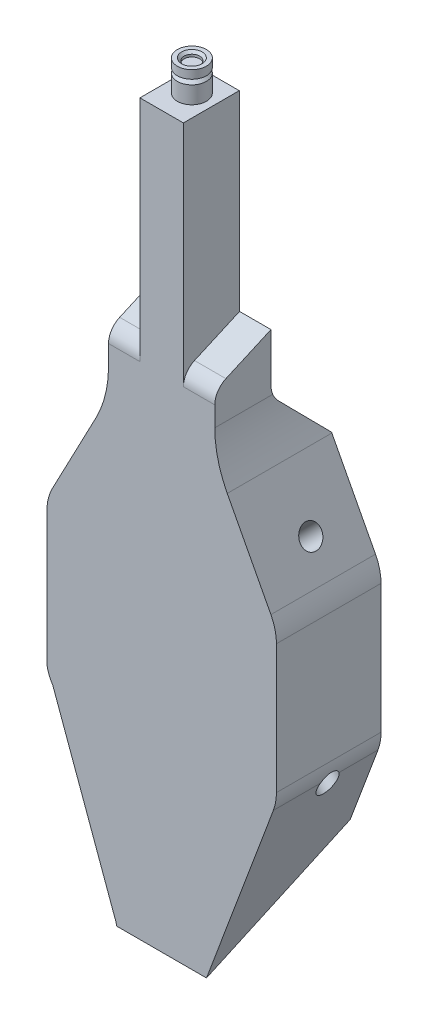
ISO-10303-21;
HEADER;
FILE_DESCRIPTION(('STEP AP214'),'2;1');
FILE_NAME('part.step','',(''),(''),'','','');
FILE_SCHEMA(('AUTOMOTIVE_DESIGN { 1 0 10303 214 1 1 1 1 }'));
ENDSEC;
DATA;
#1=APPLICATION_CONTEXT('core data for automotive mechanical design processes');
#2=APPLICATION_PROTOCOL_DEFINITION('international standard','automotive_design',2000,#1);
#3=PRODUCT_CONTEXT('',#1,'mechanical');
#4=PRODUCT('Part','Part','',(#3));
#5=PRODUCT_RELATED_PRODUCT_CATEGORY('part','',(#4));
#6=PRODUCT_DEFINITION_FORMATION('','',#4);
#7=PRODUCT_DEFINITION_CONTEXT('part definition',#1,'design');
#8=PRODUCT_DEFINITION('design','',#6,#7);
#9=PRODUCT_DEFINITION_SHAPE('','',#8);
#10=(LENGTH_UNIT() NAMED_UNIT(*) SI_UNIT(.MILLI.,.METRE.));
#11=(NAMED_UNIT(*) PLANE_ANGLE_UNIT() SI_UNIT($,.RADIAN.));
#12=(NAMED_UNIT(*) SI_UNIT($,.STERADIAN.) SOLID_ANGLE_UNIT());
#13=UNCERTAINTY_MEASURE_WITH_UNIT(LENGTH_MEASURE(1.E-05),#10,'distance_accuracy_value','');
#14=(GEOMETRIC_REPRESENTATION_CONTEXT(3) GLOBAL_UNCERTAINTY_ASSIGNED_CONTEXT((#13)) GLOBAL_UNIT_ASSIGNED_CONTEXT((#10,
#11,#12)) REPRESENTATION_CONTEXT('',''));
#15=CARTESIAN_POINT('',(0.,0.,0.));
#16=DIRECTION('',(0.,0.,1.));
#17=DIRECTION('',(1.,0.,0.));
#18=AXIS2_PLACEMENT_3D('',#15,#16,#17);
#19=CARTESIAN_POINT('',(0.,137.601457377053,30.8096898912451));
#20=DIRECTION('',(0.,-1.,0.));
#21=DIRECTION('',(0.,0.,-1.));
#22=AXIS2_PLACEMENT_3D('',#19,#20,#21);
#23=PLANE('',#22);
#24=CARTESIAN_POINT('',(0.,137.601457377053,30.8096898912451));
#25=DIRECTION('',(0.,-1.,0.));
#26=DIRECTION('',(0.,0.,-1.));
#27=AXIS2_PLACEMENT_3D('',#24,#25,#26);
#28=CIRCLE('',#27,3.25);
#29=CARTESIAN_POINT('',(0.,137.601457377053,27.5596898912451));
#30=VERTEX_POINT('',#29);
#31=EDGE_CURVE('E20',#30,#30,#28,.F.);
#32=ORIENTED_EDGE('',*,*,#31,.T.);
#33=EDGE_LOOP('',(#32));
#34=FACE_BOUND('',#33,.T.);
#35=ADVANCED_FACE('F17',(#34),#23,.F.);
#36=CARTESIAN_POINT('',(0.,137.601457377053,30.8096898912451));
#37=DIRECTION('',(0.,-1.,0.));
#38=DIRECTION('',(0.,0.,-1.));
#39=AXIS2_PLACEMENT_3D('',#36,#37,#38);
#40=CYLINDRICAL_SURFACE('',#39,3.25);
#41=ORIENTED_EDGE('',*,*,#31,.F.);
#42=EDGE_LOOP('',(#41));
#43=FACE_BOUND('',#42,.T.);
#44=CARTESIAN_POINT('',(0.,138.601457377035,30.8096898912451));
#45=DIRECTION('',(0.,1.,0.));
#46=DIRECTION('',(0.,0.,1.));
#47=AXIS2_PLACEMENT_3D('',#44,#45,#46);
#48=CIRCLE('',#47,3.25000000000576);
#49=CARTESIAN_POINT('',(0.,138.601457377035,34.0596898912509));
#50=VERTEX_POINT('',#49);
#51=EDGE_CURVE('E308',#50,#50,#48,.T.);
#52=ORIENTED_EDGE('',*,*,#51,.T.);
#53=EDGE_LOOP('',(#52));
#54=FACE_BOUND('',#53,.T.);
#55=ADVANCED_FACE('F991',(#43,#54),#40,.F.);
#56=CARTESIAN_POINT('',(0.,139.601457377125,30.8096898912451));
#57=DIRECTION('',(0.,1.,0.));
#58=DIRECTION('',(0.,0.,1.));
#59=AXIS2_PLACEMENT_3D('',#56,#57,#58);
#60=CONICAL_SURFACE('',#59,4.2500000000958,0.785398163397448);
#61=CARTESIAN_POINT('',(0.,139.601457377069,30.8096898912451));
#62=DIRECTION('',(0.,1.,0.));
#63=DIRECTION('',(0.,0.,1.));
#64=AXIS2_PLACEMENT_3D('',#61,#62,#63);
#65=CIRCLE('',#64,4.25000000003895);
#66=CARTESIAN_POINT('',(0.,139.601457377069,35.0596898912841));
#67=VERTEX_POINT('',#66);
#68=EDGE_CURVE('E294',#67,#67,#65,.T.);
#69=ORIENTED_EDGE('',*,*,#68,.T.);
#70=EDGE_LOOP('',(#69));
#71=FACE_BOUND('',#70,.T.);
#72=ORIENTED_EDGE('',*,*,#51,.F.);
#73=EDGE_LOOP('',(#72));
#74=FACE_BOUND('',#73,.T.);
#75=ADVANCED_FACE('F988',(#71,#74),#60,.F.);
#76=CARTESIAN_POINT('',(0.,139.601457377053,30.8096898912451));
#77=DIRECTION('',(0.,-1.,0.));
#78=DIRECTION('',(0.,0.,-1.));
#79=AXIS2_PLACEMENT_3D('',#76,#77,#78);
#80=PLANE('',#79);
#81=CARTESIAN_POINT('',(0.,139.601457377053,30.8096898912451));
#82=DIRECTION('',(0.,1.,0.));
#83=DIRECTION('',(0.,0.,1.));
#84=AXIS2_PLACEMENT_3D('',#81,#82,#83);
#85=CIRCLE('',#84,6.);
#86=CARTESIAN_POINT('',(0.,139.601457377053,36.8096898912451));
#87=VERTEX_POINT('',#86);
#88=EDGE_CURVE('E300',#87,#87,#85,.F.);
#89=ORIENTED_EDGE('',*,*,#88,.F.);
#90=EDGE_LOOP('',(#89));
#91=FACE_BOUND('',#90,.T.);
#92=ORIENTED_EDGE('',*,*,#68,.F.);
#93=EDGE_LOOP('',(#92));
#94=FACE_BOUND('',#93,.T.);
#95=ADVANCED_FACE('F984',(#91,#94),#80,.F.);
#96=CARTESIAN_POINT('',(-17.,-102.632217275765,13.));
#97=DIRECTION('',(0.,0.,1.));
#98=DIRECTION('',(1.,0.,0.));
#99=AXIS2_PLACEMENT_3D('',#96,#97,#98);
#100=PLANE('',#99);
#101=CARTESIAN_POINT('',(-17.,-102.632217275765,13.));
#102=DIRECTION('',(0.,0.,-1.));
#103=DIRECTION('',(-1.,0.,0.));
#104=AXIS2_PLACEMENT_3D('',#101,#102,#103);
#105=CIRCLE('',#104,3.);
#106=CARTESIAN_POINT('',(-20.,-102.632217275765,13.));
#107=VERTEX_POINT('',#106);
#108=EDGE_CURVE('E1759',#107,#107,#105,.F.);
#109=ORIENTED_EDGE('',*,*,#108,.F.);
#110=EDGE_LOOP('',(#109));
#111=FACE_BOUND('',#110,.T.);
#112=ADVANCED_FACE('F980',(#111),#100,.F.);
#113=CARTESIAN_POINT('',(17.,-102.632217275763,13.));
#114=DIRECTION('',(0.,0.,1.));
#115=DIRECTION('',(1.,0.,0.));
#116=AXIS2_PLACEMENT_3D('',#113,#114,#115);
#117=PLANE('',#116);
#118=CARTESIAN_POINT('',(17.,-102.632217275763,13.));
#119=DIRECTION('',(0.,0.,-1.));
#120=DIRECTION('',(-1.,0.,0.));
#121=AXIS2_PLACEMENT_3D('',#118,#119,#120);
#122=CIRCLE('',#121,3.);
#123=CARTESIAN_POINT('',(14.,-102.632217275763,13.));
#124=VERTEX_POINT('',#123);
#125=EDGE_CURVE('E1763',#124,#124,#122,.F.);
#126=ORIENTED_EDGE('',*,*,#125,.F.);
#127=EDGE_LOOP('',(#126));
#128=FACE_BOUND('',#127,.T.);
#129=ADVANCED_FACE('F976',(#128),#117,.F.);
#130=CARTESIAN_POINT('',(0.,-75.6322172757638,20.));
#131=DIRECTION('',(0.,0.,1.));
#132=DIRECTION('',(1.,0.,0.));
#133=AXIS2_PLACEMENT_3D('',#130,#131,#132);
#134=PLANE('',#133);
#135=CARTESIAN_POINT('',(0.,-86.6322172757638,20.));
#136=DIRECTION('',(0.,0.,-1.));
#137=DIRECTION('',(-1.,0.,0.));
#138=AXIS2_PLACEMENT_3D('',#135,#136,#137);
#139=CIRCLE('',#138,2.5);
#140=CARTESIAN_POINT('',(-2.50000000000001,-86.6322172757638,20.));
#141=VERTEX_POINT('',#140);
#142=EDGE_CURVE('E1774',#141,#141,#139,.F.);
#143=ORIENTED_EDGE('',*,*,#142,.F.);
#144=EDGE_LOOP('',(#143));
#145=FACE_BOUND('',#144,.T.);
#146=ADVANCED_FACE('F972',(#145),#134,.F.);
#147=CARTESIAN_POINT('',(-24.,-59.6322172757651,13.));
#148=DIRECTION('',(0.,0.,1.));
#149=DIRECTION('',(1.,0.,0.));
#150=AXIS2_PLACEMENT_3D('',#147,#148,#149);
#151=PLANE('',#150);
#152=CARTESIAN_POINT('',(-27.,-59.6322172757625,13.));
#153=DIRECTION('',(0.,0.,-1.));
#154=DIRECTION('',(-1.,0.,0.));
#155=AXIS2_PLACEMENT_3D('',#152,#153,#154);
#156=CIRCLE('',#155,3.);
#157=CARTESIAN_POINT('',(-30.,-59.6322172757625,13.));
#158=VERTEX_POINT('',#157);
#159=EDGE_CURVE('E1777',#158,#158,#156,.F.);
#160=ORIENTED_EDGE('',*,*,#159,.F.);
#161=EDGE_LOOP('',(#160));
#162=FACE_BOUND('',#161,.T.);
#163=ADVANCED_FACE('F968',(#162),#151,.F.);
#164=CARTESIAN_POINT('',(24.,-59.6322172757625,13.));
#165=DIRECTION('',(0.,0.,1.));
#166=DIRECTION('',(1.,0.,0.));
#167=AXIS2_PLACEMENT_3D('',#164,#165,#166);
#168=PLANE('',#167);
#169=CARTESIAN_POINT('',(27.,-59.6322172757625,13.));
#170=DIRECTION('',(0.,0.,-1.));
#171=DIRECTION('',(-1.,0.,0.));
#172=AXIS2_PLACEMENT_3D('',#169,#170,#171);
#173=CIRCLE('',#172,3.);
#174=CARTESIAN_POINT('',(24.,-59.6322172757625,13.));
#175=VERTEX_POINT('',#174);
#176=EDGE_CURVE('E958',#175,#175,#173,.F.);
#177=ORIENTED_EDGE('',*,*,#176,.F.);
#178=EDGE_LOOP('',(#177));
#179=FACE_BOUND('',#178,.T.);
#180=ADVANCED_FACE('F963',(#179),#168,.F.);
#181=CARTESIAN_POINT('',(-62.25430326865,6.30688524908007,19.9761465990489));
#182=DIRECTION('',(-0.700909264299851,0.713250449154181,0.));
#183=DIRECTION('',(-0.713250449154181,-0.700909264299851,0.));
#184=AXIS2_PLACEMENT_3D('',#181,#182,#183);
#185=CYLINDRICAL_SURFACE('',#184,4.5);
#186=DIRECTION('',(-0.700909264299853,0.71325044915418,0.));
#187=VECTOR('',#186,1.);
#188=CARTESIAN_POINT('',(1.28832013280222,-64.7746997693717,20.));
#189=LINE('',#188,#187);
#190=CARTESIAN_POINT('',(1.28832013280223,-64.7746997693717,20.));
#191=VERTEX_POINT('',#190);
#192=CARTESIAN_POINT('',(-0.631106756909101,-62.821476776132,20.));
#193=VERTEX_POINT('',#192);
#194=EDGE_CURVE('E293',#191,#193,#189,.T.);
#195=ORIENTED_EDGE('',*,*,#194,.T.);
#196=CARTESIAN_POINT('',(-0.575572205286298,-56.4578474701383,19.9761465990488));
#197=DIRECTION('',(-0.999961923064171,0.00872653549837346,0.));
#198=DIRECTION('',(0.00872653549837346,0.999961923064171,0.));
#199=AXIS2_PLACEMENT_3D('',#196,#197,#198);
#200=ELLIPSE('',#199,6.36396103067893,4.5);
#201=CARTESIAN_POINT('',(-0.608293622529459,-60.2073505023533,23.6120891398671));
#202=VERTEX_POINT('',#201);
#203=EDGE_CURVE('E284',#193,#202,#200,.T.);
#204=ORIENTED_EDGE('',*,*,#203,.T.);
#205=CARTESIAN_POINT('',(1.28832013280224,-64.7746997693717,20.));
#206=CARTESIAN_POINT('',(1.28878026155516,-64.7743808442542,20.1054665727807));
#207=CARTESIAN_POINT('',(1.29257193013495,-64.7721417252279,20.210905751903));
#208=CARTESIAN_POINT('',(1.3065636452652,-64.7636502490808,20.4211662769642));
#209=CARTESIAN_POINT('',(1.31676185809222,-64.7573990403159,20.5259877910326));
#210=CARTESIAN_POINT('',(1.34335297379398,-64.7406851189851,20.734828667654));
#211=CARTESIAN_POINT('',(1.35976466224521,-64.7302096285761,20.8388446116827));
#212=CARTESIAN_POINT('',(1.39831274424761,-64.704717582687,21.0452557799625));
#213=CARTESIAN_POINT('',(1.42044991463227,-64.6897004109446,21.147650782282));
#214=CARTESIAN_POINT('',(1.47438124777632,-64.6514955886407,21.3688933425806));
#215=CARTESIAN_POINT('',(1.50720131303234,-64.6273156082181,21.4873222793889));
#216=CARTESIAN_POINT('',(1.57881784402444,-64.571135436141,21.7204644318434));
#217=CARTESIAN_POINT('',(1.61761440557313,-64.5391351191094,21.835177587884));
#218=CARTESIAN_POINT('',(1.69968353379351,-64.4663600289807,22.0599431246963));
#219=CARTESIAN_POINT('',(1.74294962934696,-64.4255978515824,22.1700019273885));
#220=CARTESIAN_POINT('',(1.83229742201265,-64.3342062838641,22.3847283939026));
#221=CARTESIAN_POINT('',(1.87837769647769,-64.2835818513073,22.4893987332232));
#222=CARTESIAN_POINT('',(1.9565124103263,-64.1893038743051,22.6600200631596));
#223=CARTESIAN_POINT('',(1.98835967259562,-64.1485654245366,22.727685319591));
#224=CARTESIAN_POINT('',(2.05166121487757,-64.0617529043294,22.85968559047));
#225=CARTESIAN_POINT('',(2.08311559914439,-64.0156802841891,22.9240215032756));
#226=CARTESIAN_POINT('',(2.14475127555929,-63.9180503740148,23.0488977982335));
#227=CARTESIAN_POINT('',(2.174934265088,-63.8665007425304,23.1094432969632));
#228=CARTESIAN_POINT('',(2.23311982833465,-63.757819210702,23.2264007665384));
#229=CARTESIAN_POINT('',(2.26112277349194,-63.7006882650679,23.282813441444));
#230=CARTESIAN_POINT('',(2.3312806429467,-63.5415361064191,23.4266724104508));
#231=CARTESIAN_POINT('',(2.37067566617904,-63.4346429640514,23.5102138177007));
#232=CARTESIAN_POINT('',(2.43578794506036,-63.207437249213,23.6632296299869));
#233=CARTESIAN_POINT('',(2.46150997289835,-63.0871293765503,23.7327089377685));
#234=CARTESIAN_POINT('',(2.49489291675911,-62.8361454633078,23.8572290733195));
#235=CARTESIAN_POINT('',(2.50247191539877,-62.7054251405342,23.9122034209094));
#236=CARTESIAN_POINT('',(2.4960952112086,-62.4393152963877,24.0077983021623));
#237=CARTESIAN_POINT('',(2.48213976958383,-62.3039258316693,24.0484190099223));
#238=CARTESIAN_POINT('',(2.4333476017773,-62.0450313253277,24.11415065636));
#239=CARTESIAN_POINT('',(2.40026312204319,-61.921438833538,24.1402394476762));
#240=CARTESIAN_POINT('',(2.31486812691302,-61.6794040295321,24.1831757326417));
#241=CARTESIAN_POINT('',(2.26255762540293,-61.5609617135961,24.2000232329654));
#242=CARTESIAN_POINT('',(2.13956987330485,-61.3325502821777,24.2259296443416));
#243=CARTESIAN_POINT('',(2.06882551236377,-61.2226140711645,24.2349595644));
#244=CARTESIAN_POINT('',(1.91084723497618,-61.0149070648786,24.246049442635));
#245=CARTESIAN_POINT('',(1.82361184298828,-60.9171373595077,24.2481087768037));
#246=CARTESIAN_POINT('',(1.63323378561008,-60.7347878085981,24.2454604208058));
#247=CARTESIAN_POINT('',(1.52982622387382,-60.650486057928,24.2406265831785));
#248=CARTESIAN_POINT('',(1.31134644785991,-60.4996152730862,24.2234192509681));
#249=CARTESIAN_POINT('',(1.19627398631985,-60.4330466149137,24.2110455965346));
#250=CARTESIAN_POINT('',(0.958253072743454,-60.3194024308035,24.1775537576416));
#251=CARTESIAN_POINT('',(0.835316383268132,-60.2722985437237,24.1564483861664));
#252=CARTESIAN_POINT('',(0.585640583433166,-60.1982981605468,24.10386636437));
#253=CARTESIAN_POINT('',(0.458902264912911,-60.1713974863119,24.0723918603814));
#254=CARTESIAN_POINT('',(0.208817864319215,-60.1378220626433,23.9982558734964));
#255=CARTESIAN_POINT('',(0.0854542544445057,-60.1307579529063,23.9558278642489));
#256=CARTESIAN_POINT('',(-0.155948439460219,-60.134173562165,23.8585468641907));
#257=CARTESIAN_POINT('',(-0.273992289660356,-60.1446372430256,23.8037052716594));
#258=CARTESIAN_POINT('',(-0.425318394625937,-60.1683596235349,23.7222844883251));
#259=CARTESIAN_POINT('',(-0.462744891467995,-60.1751276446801,23.7011756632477));
#260=CARTESIAN_POINT('',(-0.536407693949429,-60.1901545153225,23.6576315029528));
#261=CARTESIAN_POINT('',(-0.572646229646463,-60.1984103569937,23.6351989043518));
#262=CARTESIAN_POINT('',(-0.608293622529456,-60.2073505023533,23.6120891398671));
#263=B_SPLINE_CURVE_WITH_KNOTS('',3,(#205,#206,#207,#208,#209,#210,#211,#212,#213,#214,#215,
#216,#217,#218,#219,#220,#221,#222,#223,#224,#225,#226,#227,#228,#229,#230,#231,#232,#233,#234,
#235,#236,#237,#238,#239,#240,#241,#242,#243,#244,#245,#246,#247,#248,#249,#250,#251,#252,#253,
#254,#255,#256,#257,#258,#259,#260,#261,#262),.UNSPECIFIED.,.F.,.F.,(4,2,2,2,2,2,2,2,2,2,2,2,2,
2,2,2,2,2,2,2,2,2,2,2,2,2,2,2,4),(0.,0.316324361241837,0.632558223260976,0.949755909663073,
1.26699665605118,1.64229747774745,2.01760431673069,2.39237519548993,2.76695816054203,
3.0222384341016,3.27744946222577,3.53230820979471,3.78712343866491,4.2090176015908,
4.63076441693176,5.05441189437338,5.47805423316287,5.86794397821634,6.25783344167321,
6.64916266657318,7.04052692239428,7.43914586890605,7.83777326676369,8.23581777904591,
8.63377995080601,9.02387424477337,9.41361179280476,9.54406452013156,9.67425641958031),.UNSPECIFIED.);
#264=EDGE_CURVE('E304',#191,#202,#263,.T.);
#265=ORIENTED_EDGE('',*,*,#264,.F.);
#266=EDGE_LOOP('',(#195,#204,#265));
#267=FACE_BOUND('',#266,.T.);
#268=ADVANCED_FACE('F302',(#267),#185,.F.);
#269=CARTESIAN_POINT('',(55.0745251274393,-1.77064912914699,19.9761465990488));
#270=DIRECTION('',(0.713250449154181,0.700909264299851,0.));
#271=DIRECTION('',(-0.700909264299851,0.713250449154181,0.));
#272=AXIS2_PLACEMENT_3D('',#269,#270,#271);
#273=CYLINDRICAL_SURFACE('',#272,4.5);
#274=DIRECTION('',(-0.71325044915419,-0.700909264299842,0.));
#275=VECTOR('',#274,1.);
#276=CARTESIAN_POINT('',(-0.63110675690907,-62.821476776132,20.));
#277=LINE('',#276,#275);
#278=CARTESIAN_POINT('',(-1.98502958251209,-64.1519730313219,20.));
#279=VERTEX_POINT('',#278);
#280=EDGE_CURVE('E287',#193,#279,#277,.T.);
#281=ORIENTED_EDGE('',*,*,#280,.T.);
#282=CARTESIAN_POINT('',(-0.608293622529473,-60.2073505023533,23.612089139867));
#283=CARTESIAN_POINT('',(-0.663370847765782,-60.2211547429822,23.6330569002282));
#284=CARTESIAN_POINT('',(-0.718521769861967,-60.2369962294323,23.6524865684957));
#285=CARTESIAN_POINT('',(-0.828469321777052,-60.2727754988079,23.6883390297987));
#286=CARTESIAN_POINT('',(-0.883265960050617,-60.2927131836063,23.7047618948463));
#287=CARTESIAN_POINT('',(-0.991963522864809,-60.3366901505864,23.734659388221));
#288=CARTESIAN_POINT('',(-1.04586511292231,-60.3607262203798,23.7481363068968));
#289=CARTESIAN_POINT('',(-1.1523196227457,-60.4128304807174,23.7722386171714));
#290=CARTESIAN_POINT('',(-1.20487258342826,-60.440898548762,23.7828640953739));
#291=CARTESIAN_POINT('',(-1.35989919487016,-60.5310455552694,23.8105989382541));
#292=CARTESIAN_POINT('',(-1.4597616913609,-60.5990757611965,23.823572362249));
#293=CARTESIAN_POINT('',(-1.64899809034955,-60.7492877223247,23.8389251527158));
#294=CARTESIAN_POINT('',(-1.7383739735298,-60.8314667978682,23.8413065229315));
#295=CARTESIAN_POINT('',(-1.90385011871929,-61.0074453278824,23.8356067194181));
#296=CARTESIAN_POINT('',(-1.9799930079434,-61.1012057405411,23.8275598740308));
#297=CARTESIAN_POINT('',(-2.11739884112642,-61.2976782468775,23.8007305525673));
#298=CARTESIAN_POINT('',(-2.17866048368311,-61.4003911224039,23.7819471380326));
#299=CARTESIAN_POINT('',(-2.28507776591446,-61.6112582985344,23.7330323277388));
#300=CARTESIAN_POINT('',(-2.33023971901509,-61.7194104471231,23.7029053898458));
#301=CARTESIAN_POINT('',(-2.40421530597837,-61.9372506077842,23.6306776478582));
#302=CARTESIAN_POINT('',(-2.4330326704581,-62.046938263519,23.5885795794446));
#303=CARTESIAN_POINT('',(-2.47533123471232,-62.2646245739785,23.4917535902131));
#304=CARTESIAN_POINT('',(-2.48869864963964,-62.3726049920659,23.4369354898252));
#305=CARTESIAN_POINT('',(-2.50171212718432,-62.5823133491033,23.3151470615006));
#306=CARTESIAN_POINT('',(-2.50135568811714,-62.684040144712,23.2481745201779));
#307=CARTESIAN_POINT('',(-2.48938509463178,-62.8846091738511,23.0983823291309));
#308=CARTESIAN_POINT('',(-2.4770530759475,-62.9828517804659,23.0148235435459));
#309=CARTESIAN_POINT('',(-2.44390714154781,-63.1671055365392,22.8366376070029));
#310=CARTESIAN_POINT('',(-2.42308753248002,-63.2531084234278,22.7420030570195));
#311=CARTESIAN_POINT('',(-2.38249930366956,-63.3921831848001,22.5685134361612));
#312=CARTESIAN_POINT('',(-2.3637775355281,-63.4481035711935,22.491656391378));
#313=CARTESIAN_POINT('',(-2.32500421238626,-63.5528003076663,22.3334969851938));
#314=CARTESIAN_POINT('',(-2.30495209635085,-63.6015736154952,22.2521927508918));
#315=CARTESIAN_POINT('',(-2.26467884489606,-63.6922630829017,22.0857008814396));
#316=CARTESIAN_POINT('',(-2.24445746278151,-63.7341661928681,22.0005062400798));
#317=CARTESIAN_POINT('',(-2.20489126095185,-63.8113417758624,21.8269922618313));
#318=CARTESIAN_POINT('',(-2.18554634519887,-63.8466149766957,21.7386732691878));
#319=CARTESIAN_POINT('',(-2.14811327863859,-63.9116910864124,21.5572505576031));
#320=CARTESIAN_POINT('',(-2.1300675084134,-63.941338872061,21.4640826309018));
#321=CARTESIAN_POINT('',(-2.09650012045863,-63.9944485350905,21.2755530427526));
#322=CARTESIAN_POINT('',(-2.08097869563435,-64.0179099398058,21.1801912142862));
#323=CARTESIAN_POINT('',(-2.05305725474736,-64.0589518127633,20.9878968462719));
#324=CARTESIAN_POINT('',(-2.04065320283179,-64.0765398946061,20.8909665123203));
#325=CARTESIAN_POINT('',(-2.01937623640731,-64.1061408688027,20.6959016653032));
#326=CARTESIAN_POINT('',(-2.01050235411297,-64.1181552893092,20.5977674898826));
#327=CARTESIAN_POINT('',(-1.99768730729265,-64.1353289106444,20.4163626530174));
#328=CARTESIAN_POINT('',(-1.9931868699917,-64.1412733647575,20.3332043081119));
#329=CARTESIAN_POINT('',(-1.98698939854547,-64.1494124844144,20.1667021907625));
#330=CARTESIAN_POINT('',(-1.98528894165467,-64.1516117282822,20.0833587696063));
#331=CARTESIAN_POINT('',(-1.98502958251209,-64.1519730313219,20.));
#332=B_SPLINE_CURVE_WITH_KNOTS('',3,(#282,#283,#284,#285,#286,#287,#288,#289,#290,#291,#292,
#293,#294,#295,#296,#297,#298,#299,#300,#301,#302,#303,#304,#305,#306,#307,#308,#309,#310,#311,
#312,#313,#314,#315,#316,#317,#318,#319,#320,#321,#322,#323,#324,#325,#326,#327,#328,#329,#330,
#331),.UNSPECIFIED.,.F.,.F.,(4,2,2,2,2,2,2,2,2,2,2,2,2,2,2,2,2,2,2,2,2,2,2,2,4),(0.,
0.181530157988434,0.363055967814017,0.544440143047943,0.725818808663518,1.08850671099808,
1.4511259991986,1.81255461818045,2.17401483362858,2.53533314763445,2.89656895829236,
3.26044855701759,3.62439448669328,4.01159499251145,4.39905565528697,4.68930517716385,
4.97967789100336,5.27059591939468,5.56148199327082,5.85949188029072,6.15752452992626,
6.45516932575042,6.75273246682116,7.00308002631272,7.25312132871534),.UNSPECIFIED.);
#333=EDGE_CURVE('E289',#202,#279,#332,.T.);
#334=ORIENTED_EDGE('',*,*,#333,.F.);
#335=ORIENTED_EDGE('',*,*,#203,.F.);
#336=EDGE_LOOP('',(#281,#334,#335));
#337=FACE_BOUND('',#336,.T.);
#338=ADVANCED_FACE('F286',(#337),#273,.F.);
#339=CARTESIAN_POINT('',(0.,-51.6322172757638,20.));
#340=DIRECTION('',(0.,0.,1.));
#341=DIRECTION('',(1.,0.,0.));
#342=AXIS2_PLACEMENT_3D('',#339,#340,#341);
#343=PLANE('',#342);
#344=ORIENTED_EDGE('',*,*,#194,.F.);
#345=CARTESIAN_POINT('',(0.,-62.6322172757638,20.));
#346=DIRECTION('',(0.,0.,-1.));
#347=DIRECTION('',(-1.,0.,0.));
#348=AXIS2_PLACEMENT_3D('',#345,#346,#347);
#349=CIRCLE('',#348,2.5);
#350=EDGE_CURVE('E299',#279,#191,#349,.F.);
#351=ORIENTED_EDGE('',*,*,#350,.F.);
#352=ORIENTED_EDGE('',*,*,#280,.F.);
#353=EDGE_LOOP('',(#344,#351,#352));
#354=FACE_BOUND('',#353,.T.);
#355=ADVANCED_FACE('F297',(#354),#343,.F.);
#356=CARTESIAN_POINT('',(0.,139.601457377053,30.8096898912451));
#357=DIRECTION('',(0.,1.,0.));
#358=DIRECTION('',(0.,0.,1.));
#359=AXIS2_PLACEMENT_3D('',#356,#357,#358);
#360=CYLINDRICAL_SURFACE('',#359,6.);
#361=CARTESIAN_POINT('',(0.,136.151457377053,30.8096898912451));
#362=DIRECTION('',(0.,1.,0.));
#363=DIRECTION('',(0.,0.,1.));
#364=AXIS2_PLACEMENT_3D('',#361,#362,#363);
#365=CIRCLE('',#364,6.);
#366=CARTESIAN_POINT('',(0.,136.151457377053,36.8096898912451));
#367=VERTEX_POINT('',#366);
#368=EDGE_CURVE('E1747',#367,#367,#365,.F.);
#369=ORIENTED_EDGE('',*,*,#368,.F.);
#370=EDGE_LOOP('',(#369));
#371=FACE_BOUND('',#370,.T.);
#372=ORIENTED_EDGE('',*,*,#88,.T.);
#373=EDGE_LOOP('',(#372));
#374=FACE_BOUND('',#373,.T.);
#375=ADVANCED_FACE('F1753',(#371,#374),#360,.T.);
#376=CARTESIAN_POINT('',(-17.,-102.632217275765,13.));
#377=DIRECTION('',(0.,0.,-1.));
#378=DIRECTION('',(-1.,0.,0.));
#379=AXIS2_PLACEMENT_3D('',#376,#377,#378);
#380=CYLINDRICAL_SURFACE('',#379,3.);
#381=CARTESIAN_POINT('',(-17.,-102.632217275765,35.));
#382=DIRECTION('',(0.,0.,-1.));
#383=DIRECTION('',(-1.,0.,0.));
#384=AXIS2_PLACEMENT_3D('',#381,#382,#383);
#385=CIRCLE('',#384,3.);
#386=CARTESIAN_POINT('',(-20.,-102.632217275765,35.));
#387=VERTEX_POINT('',#386);
#388=EDGE_CURVE('E1743',#387,#387,#385,.T.);
#389=ORIENTED_EDGE('',*,*,#388,.T.);
#390=EDGE_LOOP('',(#389));
#391=FACE_BOUND('',#390,.T.);
#392=ORIENTED_EDGE('',*,*,#108,.T.);
#393=EDGE_LOOP('',(#392));
#394=FACE_BOUND('',#393,.T.);
#395=ADVANCED_FACE('F1310',(#391,#394),#380,.T.);
#396=CARTESIAN_POINT('',(17.,-102.632217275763,13.));
#397=DIRECTION('',(0.,0.,-1.));
#398=DIRECTION('',(-1.,0.,0.));
#399=AXIS2_PLACEMENT_3D('',#396,#397,#398);
#400=CYLINDRICAL_SURFACE('',#399,3.);
#401=ORIENTED_EDGE('',*,*,#125,.T.);
#402=EDGE_LOOP('',(#401));
#403=FACE_BOUND('',#402,.T.);
#404=CARTESIAN_POINT('',(17.,-102.632217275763,35.));
#405=DIRECTION('',(0.,0.,-1.));
#406=DIRECTION('',(-1.,0.,0.));
#407=AXIS2_PLACEMENT_3D('',#404,#405,#406);
#408=CIRCLE('',#407,3.);
#409=CARTESIAN_POINT('',(14.,-102.632217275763,35.));
#410=VERTEX_POINT('',#409);
#411=EDGE_CURVE('E1739',#410,#410,#408,.T.);
#412=ORIENTED_EDGE('',*,*,#411,.T.);
#413=EDGE_LOOP('',(#412));
#414=FACE_BOUND('',#413,.T.);
#415=ADVANCED_FACE('F1307',(#403,#414),#400,.T.);
#416=CARTESIAN_POINT('',(0.,-86.6322172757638,20.));
#417=DIRECTION('',(0.,0.,-1.));
#418=DIRECTION('',(-1.,0.,0.));
#419=AXIS2_PLACEMENT_3D('',#416,#417,#418);
#420=CYLINDRICAL_SURFACE('',#419,2.5);
#421=CARTESIAN_POINT('',(0.,-86.6322172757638,35.));
#422=DIRECTION('',(0.,0.,-1.));
#423=DIRECTION('',(-1.,0.,0.));
#424=AXIS2_PLACEMENT_3D('',#421,#422,#423);
#425=CIRCLE('',#424,2.5);
#426=CARTESIAN_POINT('',(-2.50000000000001,-86.6322172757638,35.));
#427=VERTEX_POINT('',#426);
#428=EDGE_CURVE('E1735',#427,#427,#425,.T.);
#429=ORIENTED_EDGE('',*,*,#428,.T.);
#430=EDGE_LOOP('',(#429));
#431=FACE_BOUND('',#430,.T.);
#432=ORIENTED_EDGE('',*,*,#142,.T.);
#433=EDGE_LOOP('',(#432));
#434=FACE_BOUND('',#433,.T.);
#435=ADVANCED_FACE('F1309',(#431,#434),#420,.T.);
#436=CARTESIAN_POINT('',(-27.,-59.6322172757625,13.));
#437=DIRECTION('',(0.,0.,-1.));
#438=DIRECTION('',(-1.,0.,0.));
#439=AXIS2_PLACEMENT_3D('',#436,#437,#438);
#440=CYLINDRICAL_SURFACE('',#439,3.);
#441=CARTESIAN_POINT('',(-27.,-59.6322172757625,35.));
#442=DIRECTION('',(0.,0.,-1.));
#443=DIRECTION('',(-1.,0.,0.));
#444=AXIS2_PLACEMENT_3D('',#441,#442,#443);
#445=CIRCLE('',#444,3.);
#446=CARTESIAN_POINT('',(-30.,-59.6322172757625,35.));
#447=VERTEX_POINT('',#446);
#448=EDGE_CURVE('E1731',#447,#447,#445,.T.);
#449=ORIENTED_EDGE('',*,*,#448,.T.);
#450=EDGE_LOOP('',(#449));
#451=FACE_BOUND('',#450,.T.);
#452=ORIENTED_EDGE('',*,*,#159,.T.);
#453=EDGE_LOOP('',(#452));
#454=FACE_BOUND('',#453,.T.);
#455=ADVANCED_FACE('F1352',(#451,#454),#440,.T.);
#456=CARTESIAN_POINT('',(27.,-59.6322172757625,13.));
#457=DIRECTION('',(0.,0.,-1.));
#458=DIRECTION('',(-1.,0.,0.));
#459=AXIS2_PLACEMENT_3D('',#456,#457,#458);
#460=CYLINDRICAL_SURFACE('',#459,3.);
#461=ORIENTED_EDGE('',*,*,#176,.T.);
#462=EDGE_LOOP('',(#461));
#463=FACE_BOUND('',#462,.T.);
#464=CARTESIAN_POINT('',(27.,-59.6322172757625,35.));
#465=DIRECTION('',(0.,0.,-1.));
#466=DIRECTION('',(-1.,0.,0.));
#467=AXIS2_PLACEMENT_3D('',#464,#465,#466);
#468=CIRCLE('',#467,3.);
#469=CARTESIAN_POINT('',(24.,-59.6322172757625,35.));
#470=VERTEX_POINT('',#469);
#471=EDGE_CURVE('E1727',#470,#470,#468,.T.);
#472=ORIENTED_EDGE('',*,*,#471,.T.);
#473=EDGE_LOOP('',(#472));
#474=FACE_BOUND('',#473,.T.);
#475=ADVANCED_FACE('F942',(#463,#474),#460,.T.);
#476=CARTESIAN_POINT('',(0.,-62.6322172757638,20.));
#477=DIRECTION('',(0.,0.,-1.));
#478=DIRECTION('',(-1.,0.,0.));
#479=AXIS2_PLACEMENT_3D('',#476,#477,#478);
#480=CYLINDRICAL_SURFACE('',#479,2.5);
#481=CARTESIAN_POINT('',(0.,-62.6322172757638,35.));
#482=DIRECTION('',(0.,0.,-1.));
#483=DIRECTION('',(-1.,0.,0.));
#484=AXIS2_PLACEMENT_3D('',#481,#482,#483);
#485=CIRCLE('',#484,2.5);
#486=CARTESIAN_POINT('',(-2.50000000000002,-62.6322172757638,35.));
#487=VERTEX_POINT('',#486);
#488=EDGE_CURVE('E1723',#487,#487,#485,.T.);
#489=ORIENTED_EDGE('',*,*,#488,.T.);
#490=EDGE_LOOP('',(#489));
#491=FACE_BOUND('',#490,.T.);
#492=ORIENTED_EDGE('',*,*,#333,.T.);
#493=ORIENTED_EDGE('',*,*,#350,.T.);
#494=ORIENTED_EDGE('',*,*,#264,.T.);
#495=EDGE_LOOP('',(#492,#493,#494));
#496=FACE_BOUND('',#495,.T.);
#497=ADVANCED_FACE('F937',(#491,#496),#480,.T.);
#498=CARTESIAN_POINT('',(0.,136.151457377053,30.8096898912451));
#499=DIRECTION('',(0.,-1.,0.));
#500=DIRECTION('',(0.,0.,-1.));
#501=AXIS2_PLACEMENT_3D('',#498,#499,#500);
#502=PLANE('',#501);
#503=ORIENTED_EDGE('',*,*,#368,.T.);
#504=EDGE_LOOP('',(#503));
#505=FACE_BOUND('',#504,.T.);
#506=CARTESIAN_POINT('',(0.,136.151457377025,30.8096898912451));
#507=DIRECTION('',(0.,-1.,0.));
#508=DIRECTION('',(0.,0.,-1.));
#509=AXIS2_PLACEMENT_3D('',#506,#507,#508);
#510=CIRCLE('',#509,3.99999999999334);
#511=CARTESIAN_POINT('',(0.,136.151457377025,26.8096898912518));
#512=VERTEX_POINT('',#511);
#513=EDGE_CURVE('E680',#512,#512,#510,.T.);
#514=ORIENTED_EDGE('',*,*,#513,.F.);
#515=EDGE_LOOP('',(#514));
#516=FACE_BOUND('',#515,.T.);
#517=ADVANCED_FACE('F933',(#505,#516),#502,.T.);
#518=CARTESIAN_POINT('',(-16.,-14.4703645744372,35.));
#519=DIRECTION('',(0.,0.,1.));
#520=DIRECTION('',(1.,0.,0.));
#521=AXIS2_PLACEMENT_3D('',#518,#519,#520);
#522=PLANE('',#521);
#523=ORIENTED_EDGE('',*,*,#488,.F.);
#524=EDGE_LOOP('',(#523));
#525=FACE_BOUND('',#524,.T.);
#526=ORIENTED_EDGE('',*,*,#471,.F.);
#527=EDGE_LOOP('',(#526));
#528=FACE_BOUND('',#527,.T.);
#529=ORIENTED_EDGE('',*,*,#448,.F.);
#530=EDGE_LOOP('',(#529));
#531=FACE_BOUND('',#530,.T.);
#532=DIRECTION('',(0.,1.,0.));
#533=VECTOR('',#532,1.);
#534=CARTESIAN_POINT('',(-37.4999999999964,-40.5098611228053,35.));
#535=LINE('',#534,#533);
#536=CARTESIAN_POINT('',(-37.4999999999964,-40.5098611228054,35.));
#537=VERTEX_POINT('',#536);
#538=CARTESIAN_POINT('',(-37.5,-111.632217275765,35.));
#539=VERTEX_POINT('',#538);
#540=EDGE_CURVE('E629',#537,#539,#535,.F.);
#541=ORIENTED_EDGE('',*,*,#540,.F.);
#542=CARTESIAN_POINT('',(-32.7178083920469,-40.5098611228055,35.));
#543=DIRECTION('',(0.,0.,1.));
#544=DIRECTION('',(1.,0.,0.));
#545=AXIS2_PLACEMENT_3D('',#542,#543,#544);
#546=CIRCLE('',#545,4.78219160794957);
#547=CARTESIAN_POINT('',(-32.2324123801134,-35.7523673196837,35.));
#548=VERTEX_POINT('',#547);
#549=EDGE_CURVE('E634',#537,#548,#546,.F.);
#550=ORIENTED_EDGE('',*,*,#549,.T.);
#551=DIRECTION('',(0.994835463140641,-0.101500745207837,0.));
#552=VECTOR('',#551,1.);
#553=CARTESIAN_POINT('',(-15.3938700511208,-37.4703645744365,35.));
#554=LINE('',#553,#552);
#555=CARTESIAN_POINT('',(-15.3938700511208,-37.4703645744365,35.));
#556=VERTEX_POINT('',#555);
#557=EDGE_CURVE('E697',#556,#548,#554,.F.);
#558=ORIENTED_EDGE('',*,*,#557,.F.);
#559=DIRECTION('',(1.,0.,0.));
#560=VECTOR('',#559,1.);
#561=CARTESIAN_POINT('',(-4.65655323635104,-37.4703645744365,35.));
#562=LINE('',#561,#560);
#563=CARTESIAN_POINT('',(15.7972511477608,-37.4703645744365,35.));
#564=VERTEX_POINT('',#563);
#565=EDGE_CURVE('E573',#564,#556,#562,.F.);
#566=ORIENTED_EDGE('',*,*,#565,.F.);
#567=DIRECTION('',(0.994643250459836,0.103367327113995,0.));
#568=VECTOR('',#567,1.);
#569=CARTESIAN_POINT('',(15.7972511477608,-37.4703645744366,35.));
#570=LINE('',#569,#568);
#571=CARTESIAN_POINT('',(32.2234860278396,-35.7632841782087,35.));
#572=VERTEX_POINT('',#571);
#573=EDGE_CURVE('E593',#572,#564,#570,.F.);
#574=ORIENTED_EDGE('',*,*,#573,.F.);
#575=CARTESIAN_POINT('',(32.7178083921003,-40.5198587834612,35.));
#576=DIRECTION('',(0.,0.,1.));
#577=DIRECTION('',(1.,0.,0.));
#578=AXIS2_PLACEMENT_3D('',#575,#576,#577);
#579=CIRCLE('',#578,4.78219160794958);
#580=CARTESIAN_POINT('',(37.5000000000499,-40.5198587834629,35.));
#581=VERTEX_POINT('',#580);
#582=EDGE_CURVE('E604',#572,#581,#579,.F.);
#583=ORIENTED_EDGE('',*,*,#582,.T.);
#584=DIRECTION('',(-7.02000863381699E-13,-1.,0.));
#585=VECTOR('',#584,1.);
#586=CARTESIAN_POINT('',(37.5,-111.632217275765,35.));
#587=LINE('',#586,#585);
#588=CARTESIAN_POINT('',(37.5,-111.632217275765,35.));
#589=VERTEX_POINT('',#588);
#590=EDGE_CURVE('E609',#589,#581,#587,.F.);
#591=ORIENTED_EDGE('',*,*,#590,.F.);
#592=CARTESIAN_POINT('',(32.5,-111.632217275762,35.));
#593=DIRECTION('',(0.,0.,1.));
#594=DIRECTION('',(1.,0.,0.));
#595=AXIS2_PLACEMENT_3D('',#592,#593,#594);
#596=CIRCLE('',#595,5.00000000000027);
#597=CARTESIAN_POINT('',(32.5000000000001,-116.632217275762,35.));
#598=VERTEX_POINT('',#597);
#599=EDGE_CURVE('E614',#589,#598,#596,.F.);
#600=ORIENTED_EDGE('',*,*,#599,.T.);
#601=DIRECTION('',(-1.,0.,0.));
#602=VECTOR('',#601,1.);
#603=CARTESIAN_POINT('',(32.5,-116.632217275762,35.));
#604=LINE('',#603,#602);
#605=CARTESIAN_POINT('',(-32.4999999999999,-116.632217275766,35.));
#606=VERTEX_POINT('',#605);
#607=EDGE_CURVE('E619',#606,#598,#604,.F.);
#608=ORIENTED_EDGE('',*,*,#607,.F.);
#609=CARTESIAN_POINT('',(-32.5,-111.632217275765,35.));
#610=DIRECTION('',(0.,0.,1.));
#611=DIRECTION('',(1.,0.,0.));
#612=AXIS2_PLACEMENT_3D('',#609,#610,#611);
#613=CIRCLE('',#612,5.);
#614=EDGE_CURVE('E624',#606,#539,#613,.F.);
#615=ORIENTED_EDGE('',*,*,#614,.T.);
#616=EDGE_LOOP('',(#541,#550,#558,#566,#574,#583,#591,#600,#608,#615));
#617=FACE_BOUND('',#616,.T.);
#618=ORIENTED_EDGE('',*,*,#428,.F.);
#619=EDGE_LOOP('',(#618));
#620=FACE_BOUND('',#619,.T.);
#621=ORIENTED_EDGE('',*,*,#411,.F.);
#622=EDGE_LOOP('',(#621));
#623=FACE_BOUND('',#622,.T.);
#624=ORIENTED_EDGE('',*,*,#388,.F.);
#625=EDGE_LOOP('',(#624));
#626=FACE_BOUND('',#625,.T.);
#627=ADVANCED_FACE('F929',(#525,#528,#531,#617,#620,#623,#626),#522,.F.);
#628=CARTESIAN_POINT('',(-16.,-14.4703645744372,15.));
#629=DIRECTION('',(0.,0.,1.));
#630=DIRECTION('',(1.,0.,0.));
#631=AXIS2_PLACEMENT_3D('',#628,#629,#630);
#632=PLANE('',#631);
#633=DIRECTION('',(1.,0.,0.));
#634=VECTOR('',#633,1.);
#635=CARTESIAN_POINT('',(-4.65655323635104,-37.4703645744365,15.));
#636=LINE('',#635,#634);
#637=CARTESIAN_POINT('',(-4.65655323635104,-37.4703645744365,15.));
#638=VERTEX_POINT('',#637);
#639=CARTESIAN_POINT('',(4.65655323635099,-37.4703645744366,15.));
#640=VERTEX_POINT('',#639);
#641=EDGE_CURVE('E585',#638,#640,#636,.T.);
#642=ORIENTED_EDGE('',*,*,#641,.F.);
#643=DIRECTION('',(0.,1.,0.));
#644=VECTOR('',#643,1.);
#645=CARTESIAN_POINT('',(-4.65655323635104,-29.4703645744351,15.));
#646=LINE('',#645,#644);
#647=CARTESIAN_POINT('',(-4.65655323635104,-29.4703645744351,15.));
#648=VERTEX_POINT('',#647);
#649=EDGE_CURVE('E654',#648,#638,#646,.F.);
#650=ORIENTED_EDGE('',*,*,#649,.F.);
#651=DIRECTION('',(-0.885175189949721,0.465257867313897,0.));
#652=VECTOR('',#651,1.);
#653=CARTESIAN_POINT('',(-4.65655323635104,-29.4703645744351,15.));
#654=LINE('',#653,#652);
#655=CARTESIAN_POINT('',(-19.7220629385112,-21.5517660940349,15.));
#656=VERTEX_POINT('',#655);
#657=EDGE_CURVE('E655',#656,#648,#654,.F.);
#658=ORIENTED_EDGE('',*,*,#657,.F.);
#659=CARTESIAN_POINT('',(-16.,-14.4703645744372,15.));
#660=DIRECTION('',(0.,0.,1.));
#661=DIRECTION('',(1.,0.,0.));
#662=AXIS2_PLACEMENT_3D('',#659,#660,#661);
#663=CIRCLE('',#662,8.);
#664=CARTESIAN_POINT('',(-15.9012784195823,-6.4709737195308,15.));
#665=VERTEX_POINT('',#664);
#666=EDGE_CURVE('E666',#656,#665,#663,.F.);
#667=ORIENTED_EDGE('',*,*,#666,.T.);
#668=DIRECTION('',(0.999923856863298,-0.0123401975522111,0.));
#669=VECTOR('',#668,1.);
#670=CARTESIAN_POINT('',(16.0000000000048,-6.86467177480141,15.));
#671=LINE('',#670,#669);
#672=CARTESIAN_POINT('',(16.0000000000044,-6.8646717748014,15.));
#673=VERTEX_POINT('',#672);
#674=EDGE_CURVE('E670',#673,#665,#671,.F.);
#675=ORIENTED_EDGE('',*,*,#674,.F.);
#676=CARTESIAN_POINT('',(16.,-14.8646717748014,15.));
#677=DIRECTION('',(0.,0.,1.));
#678=DIRECTION('',(1.,0.,0.));
#679=AXIS2_PLACEMENT_3D('',#676,#677,#678);
#680=CIRCLE('',#679,8.);
#681=CARTESIAN_POINT('',(19.5737541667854,-22.0220652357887,15.));
#682=VERTEX_POINT('',#681);
#683=EDGE_CURVE('E671',#673,#682,#680,.F.);
#684=ORIENTED_EDGE('',*,*,#683,.T.);
#685=DIRECTION('',(-0.894674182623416,-0.446719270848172,0.));
#686=VECTOR('',#685,1.);
#687=CARTESIAN_POINT('',(4.65655323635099,-29.4703645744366,15.));
#688=LINE('',#687,#686);
#689=CARTESIAN_POINT('',(4.65655323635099,-29.4703645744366,15.));
#690=VERTEX_POINT('',#689);
#691=EDGE_CURVE('E546',#690,#682,#688,.F.);
#692=ORIENTED_EDGE('',*,*,#691,.F.);
#693=DIRECTION('',(0.,-1.,0.));
#694=VECTOR('',#693,1.);
#695=CARTESIAN_POINT('',(4.65655323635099,-37.4703645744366,15.));
#696=LINE('',#695,#694);
#697=EDGE_CURVE('E551',#640,#690,#696,.F.);
#698=ORIENTED_EDGE('',*,*,#697,.F.);
#699=EDGE_LOOP('',(#642,#650,#658,#667,#675,#684,#692,#698));
#700=FACE_BOUND('',#699,.T.);
#701=ADVANCED_FACE('F925',(#700),#632,.F.);
#702=CARTESIAN_POINT('',(0.,134.151457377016,30.8096898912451));
#703=DIRECTION('',(0.,-1.,0.));
#704=DIRECTION('',(0.,0.,-1.));
#705=AXIS2_PLACEMENT_3D('',#702,#703,#704);
#706=CONICAL_SURFACE('',#705,6.00000000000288,0.785398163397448);
#707=ORIENTED_EDGE('',*,*,#513,.T.);
#708=EDGE_LOOP('',(#707));
#709=FACE_BOUND('',#708,.T.);
#710=CARTESIAN_POINT('',(0.,134.151457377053,30.8096898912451));
#711=DIRECTION('',(0.,-1.,0.));
#712=DIRECTION('',(0.,0.,-1.));
#713=AXIS2_PLACEMENT_3D('',#710,#711,#712);
#714=CIRCLE('',#713,6.);
#715=CARTESIAN_POINT('',(0.,134.151457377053,24.8096898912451));
#716=VERTEX_POINT('',#715);
#717=EDGE_CURVE('E501',#716,#716,#714,.T.);
#718=ORIENTED_EDGE('',*,*,#717,.F.);
#719=EDGE_LOOP('',(#718));
#720=FACE_BOUND('',#719,.T.);
#721=ADVANCED_FACE('F922',(#709,#720),#706,.T.);
#722=CARTESIAN_POINT('',(296.580168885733,49.0633895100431,38.6527722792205));
#723=DIRECTION('',(0.,-0.930898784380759,-0.365277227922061));
#724=DIRECTION('',(0.,0.365277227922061,-0.930898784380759));
#725=AXIS2_PLACEMENT_3D('',#722,#723,#724);
#726=PLANE('',#725);
#727=DIRECTION('',(0.,0.365277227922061,-0.930898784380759));
#728=VECTOR('',#727,1.);
#729=CARTESIAN_POINT('',(-9.00944412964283,49.0633895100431,38.6527722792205));
#730=LINE('',#729,#728);
#731=CARTESIAN_POINT('',(-9.00944412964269,56.3187927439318,20.1625803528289));
#732=VERTEX_POINT('',#731);
#733=CARTESIAN_POINT('',(-9.00944412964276,56.3663064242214,20.0414930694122));
#734=VERTEX_POINT('',#733);
#735=EDGE_CURVE('E672',#732,#734,#730,.T.);
#736=ORIENTED_EDGE('',*,*,#735,.F.);
#737=DIRECTION('',(1.,0.,0.));
#738=VECTOR('',#737,1.);
#739=CARTESIAN_POINT('',(148.225460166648,56.3187927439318,20.1625803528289));
#740=LINE('',#739,#738);
#741=CARTESIAN_POINT('',(8.96879235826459,56.3187927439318,20.1625803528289));
#742=VERTEX_POINT('',#741);
#743=EDGE_CURVE('E497',#732,#742,#740,.T.);
#744=ORIENTED_EDGE('',*,*,#743,.T.);
#745=DIRECTION('',(0.,0.365277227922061,-0.930898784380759));
#746=VECTOR('',#745,1.);
#747=CARTESIAN_POINT('',(8.96879235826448,49.0633895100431,38.6527722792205));
#748=LINE('',#747,#746);
#749=CARTESIAN_POINT('',(8.96879235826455,56.3663064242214,20.0414930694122));
#750=VERTEX_POINT('',#749);
#751=EDGE_CURVE('E675',#750,#742,#748,.F.);
#752=ORIENTED_EDGE('',*,*,#751,.F.);
#753=DIRECTION('',(1.,0.,0.));
#754=VECTOR('',#753,1.);
#755=CARTESIAN_POINT('',(104.760517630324,56.3663064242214,20.0414930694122));
#756=LINE('',#755,#754);
#757=EDGE_CURVE('E481',#734,#750,#756,.T.);
#758=ORIENTED_EDGE('',*,*,#757,.F.);
#759=EDGE_LOOP('',(#736,#744,#752,#758));
#760=FACE_BOUND('',#759,.T.);
#761=ADVANCED_FACE('F918',(#760),#726,.F.);
#762=CARTESIAN_POINT('',(16.,-14.8646717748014,35.));
#763=DIRECTION('',(0.,0.,1.));
#764=DIRECTION('',(1.,0.,0.));
#765=AXIS2_PLACEMENT_3D('',#762,#763,#764);
#766=CYLINDRICAL_SURFACE('',#765,8.);
#767=ORIENTED_EDGE('',*,*,#683,.F.);
#768=DIRECTION('',(0.,0.,1.));
#769=VECTOR('',#768,1.);
#770=CARTESIAN_POINT('',(16.0000000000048,-6.86467177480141,35.));
#771=LINE('',#770,#769);
#772=CARTESIAN_POINT('',(16.0000000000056,-6.86467177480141,0.));
#773=VERTEX_POINT('',#772);
#774=EDGE_CURVE('E667',#773,#673,#771,.T.);
#775=ORIENTED_EDGE('',*,*,#774,.F.);
#776=CARTESIAN_POINT('',(16.,-14.8646717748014,0.));
#777=DIRECTION('',(0.,0.,1.));
#778=DIRECTION('',(1.,0.,0.));
#779=AXIS2_PLACEMENT_3D('',#776,#777,#778);
#780=CIRCLE('',#779,8.);
#781=CARTESIAN_POINT('',(19.5737541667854,-22.0220652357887,0.));
#782=VERTEX_POINT('',#781);
#783=EDGE_CURVE('E446',#782,#773,#780,.T.);
#784=ORIENTED_EDGE('',*,*,#783,.F.);
#785=DIRECTION('',(0.,0.,1.));
#786=VECTOR('',#785,1.);
#787=CARTESIAN_POINT('',(19.5737541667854,-22.0220652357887,35.));
#788=LINE('',#787,#786);
#789=EDGE_CURVE('E542',#682,#782,#788,.F.);
#790=ORIENTED_EDGE('',*,*,#789,.F.);
#791=EDGE_LOOP('',(#767,#775,#784,#790));
#792=FACE_BOUND('',#791,.T.);
#793=ADVANCED_FACE('F914',(#792),#766,.F.);
#794=CARTESIAN_POINT('',(16.0000000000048,-6.86467177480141,35.));
#795=DIRECTION('',(-0.0123401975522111,-0.999923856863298,0.));
#796=DIRECTION('',(0.999923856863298,-0.0123401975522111,0.));
#797=AXIS2_PLACEMENT_3D('',#794,#795,#796);
#798=PLANE('',#797);
#799=DIRECTION('',(0.,0.,1.));
#800=VECTOR('',#799,1.);
#801=CARTESIAN_POINT('',(-15.9012784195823,-6.47097371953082,35.));
#802=LINE('',#801,#800);
#803=CARTESIAN_POINT('',(-15.9012784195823,-6.4709737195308,0.));
#804=VERTEX_POINT('',#803);
#805=EDGE_CURVE('E662',#665,#804,#802,.F.);
#806=ORIENTED_EDGE('',*,*,#805,.T.);
#807=DIRECTION('',(-0.999923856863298,0.01234019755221,0.));
#808=VECTOR('',#807,1.);
#809=CARTESIAN_POINT('',(16.0000000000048,-6.86467177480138,0.));
#810=LINE('',#809,#808);
#811=EDGE_CURVE('E443',#773,#804,#810,.T.);
#812=ORIENTED_EDGE('',*,*,#811,.F.);
#813=ORIENTED_EDGE('',*,*,#774,.T.);
#814=ORIENTED_EDGE('',*,*,#674,.T.);
#815=EDGE_LOOP('',(#806,#812,#813,#814));
#816=FACE_BOUND('',#815,.T.);
#817=ADVANCED_FACE('F910',(#816),#798,.T.);
#818=CARTESIAN_POINT('',(-16.,-14.4703645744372,35.));
#819=DIRECTION('',(0.,0.,1.));
#820=DIRECTION('',(1.,0.,0.));
#821=AXIS2_PLACEMENT_3D('',#818,#819,#820);
#822=CYLINDRICAL_SURFACE('',#821,8.);
#823=ORIENTED_EDGE('',*,*,#666,.F.);
#824=DIRECTION('',(0.,0.,1.));
#825=VECTOR('',#824,1.);
#826=CARTESIAN_POINT('',(-19.7220629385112,-21.5517660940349,35.));
#827=LINE('',#826,#825);
#828=CARTESIAN_POINT('',(-19.7220629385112,-21.5517660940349,0.));
#829=VERTEX_POINT('',#828);
#830=EDGE_CURVE('E658',#829,#656,#827,.T.);
#831=ORIENTED_EDGE('',*,*,#830,.F.);
#832=CARTESIAN_POINT('',(-16.,-14.4703645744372,0.));
#833=DIRECTION('',(0.,0.,1.));
#834=DIRECTION('',(1.,0.,0.));
#835=AXIS2_PLACEMENT_3D('',#832,#833,#834);
#836=CIRCLE('',#835,8.);
#837=EDGE_CURVE('E440',#804,#829,#836,.T.);
#838=ORIENTED_EDGE('',*,*,#837,.F.);
#839=ORIENTED_EDGE('',*,*,#805,.F.);
#840=EDGE_LOOP('',(#823,#831,#838,#839));
#841=FACE_BOUND('',#840,.T.);
#842=ADVANCED_FACE('F906',(#841),#822,.F.);
#843=CARTESIAN_POINT('',(-4.65655323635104,-29.4703645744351,35.));
#844=DIRECTION('',(0.465257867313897,0.885175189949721,0.));
#845=DIRECTION('',(-0.885175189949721,0.465257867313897,0.));
#846=AXIS2_PLACEMENT_3D('',#843,#844,#845);
#847=PLANE('',#846);
#848=DIRECTION('',(0.,0.,1.));
#849=VECTOR('',#848,1.);
#850=CARTESIAN_POINT('',(-4.65655323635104,-29.4703645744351,35.));
#851=LINE('',#850,#849);
#852=CARTESIAN_POINT('',(-4.65655323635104,-29.4703645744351,0.));
#853=VERTEX_POINT('',#852);
#854=EDGE_CURVE('E650',#853,#648,#851,.T.);
#855=ORIENTED_EDGE('',*,*,#854,.F.);
#856=DIRECTION('',(0.885175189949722,-0.465257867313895,0.));
#857=VECTOR('',#856,1.);
#858=CARTESIAN_POINT('',(-19.7220629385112,-21.5517660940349,0.));
#859=LINE('',#858,#857);
#860=EDGE_CURVE('E435',#829,#853,#859,.T.);
#861=ORIENTED_EDGE('',*,*,#860,.F.);
#862=ORIENTED_EDGE('',*,*,#830,.T.);
#863=ORIENTED_EDGE('',*,*,#657,.T.);
#864=EDGE_LOOP('',(#855,#861,#862,#863));
#865=FACE_BOUND('',#864,.T.);
#866=ADVANCED_FACE('F902',(#865),#847,.T.);
#867=CARTESIAN_POINT('',(-4.65655323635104,-29.4703645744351,35.));
#868=DIRECTION('',(1.,0.,0.));
#869=DIRECTION('',(0.,1.,0.));
#870=AXIS2_PLACEMENT_3D('',#867,#868,#869);
#871=PLANE('',#870);
#872=DIRECTION('',(0.,0.,1.));
#873=VECTOR('',#872,1.);
#874=CARTESIAN_POINT('',(-4.65655323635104,-37.4703645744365,35.));
#875=LINE('',#874,#873);
#876=CARTESIAN_POINT('',(-4.65655323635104,-37.4703645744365,0.));
#877=VERTEX_POINT('',#876);
#878=EDGE_CURVE('E592',#877,#638,#875,.T.);
#879=ORIENTED_EDGE('',*,*,#878,.F.);
#880=DIRECTION('',(0.,1.,0.));
#881=VECTOR('',#880,1.);
#882=CARTESIAN_POINT('',(-4.65655323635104,0.,0.));
#883=LINE('',#882,#881);
#884=EDGE_CURVE('E439',#853,#877,#883,.F.);
#885=ORIENTED_EDGE('',*,*,#884,.F.);
#886=ORIENTED_EDGE('',*,*,#854,.T.);
#887=ORIENTED_EDGE('',*,*,#649,.T.);
#888=EDGE_LOOP('',(#879,#885,#886,#887));
#889=FACE_BOUND('',#888,.T.);
#890=ADVANCED_FACE('F898',(#889),#871,.T.);
#891=CARTESIAN_POINT('',(-15.3938700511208,-37.4703645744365,35.));
#892=DIRECTION('',(-0.101500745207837,-0.994835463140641,0.));
#893=DIRECTION('',(0.994835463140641,-0.101500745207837,0.));
#894=AXIS2_PLACEMENT_3D('',#891,#892,#893);
#895=PLANE('',#894);
#896=DIRECTION('',(-0.994835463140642,0.101500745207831,0.));
#897=VECTOR('',#896,1.);
#898=CARTESIAN_POINT('',(-15.3938700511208,-37.4703645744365,0.));
#899=LINE('',#898,#897);
#900=CARTESIAN_POINT('',(-15.393870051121,-37.4703645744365,0.));
#901=VERTEX_POINT('',#900);
#902=CARTESIAN_POINT('',(-32.2324123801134,-35.7523673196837,0.));
#903=VERTEX_POINT('',#902);
#904=EDGE_CURVE('E429',#901,#903,#899,.T.);
#905=ORIENTED_EDGE('',*,*,#904,.F.);
#906=DIRECTION('',(0.,0.,1.));
#907=VECTOR('',#906,1.);
#908=CARTESIAN_POINT('',(-15.3938700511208,-37.4703645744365,35.));
#909=LINE('',#908,#907);
#910=CARTESIAN_POINT('',(-15.3938700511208,-37.4703645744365,16.405994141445));
#911=VERTEX_POINT('',#910);
#912=EDGE_CURVE('E588',#911,#901,#909,.F.);
#913=ORIENTED_EDGE('',*,*,#912,.F.);
#914=CARTESIAN_POINT('',(-19.6625026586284,-37.0348459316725,19.9761465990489));
#915=DIRECTION('',(-0.101500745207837,-0.994835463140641,0.));
#916=DIRECTION('',(-0.994835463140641,0.101500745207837,0.));
#917=AXIS2_PLACEMENT_3D('',#914,#915,#916);
#918=ELLIPSE('',#917,7.0486068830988,4.5);
#919=CARTESIAN_POINT('',(-15.3938700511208,-37.4703645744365,23.5462990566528));
#920=VERTEX_POINT('',#919);
#921=EDGE_CURVE('E2005',#911,#920,#918,.F.);
#922=ORIENTED_EDGE('',*,*,#921,.T.);
#923=DIRECTION('',(0.,0.,1.));
#924=VECTOR('',#923,1.);
#925=CARTESIAN_POINT('',(-15.3938700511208,-37.4703645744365,35.));
#926=LINE('',#925,#924);
#927=EDGE_CURVE('E563',#556,#920,#926,.F.);
#928=ORIENTED_EDGE('',*,*,#927,.F.);
#929=ORIENTED_EDGE('',*,*,#557,.T.);
#930=DIRECTION('',(0.,0.,1.));
#931=VECTOR('',#930,1.);
#932=CARTESIAN_POINT('',(-32.2324123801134,-35.7523673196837,35.));
#933=LINE('',#932,#931);
#934=EDGE_CURVE('E630',#548,#903,#933,.F.);
#935=ORIENTED_EDGE('',*,*,#934,.T.);
#936=EDGE_LOOP('',(#905,#913,#922,#928,#929,#935));
#937=FACE_BOUND('',#936,.T.);
#938=ADVANCED_FACE('F894',(#937),#895,.T.);
#939=CARTESIAN_POINT('',(-32.7178083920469,-40.5098611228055,35.));
#940=DIRECTION('',(0.,0.,1.));
#941=DIRECTION('',(1.,0.,0.));
#942=AXIS2_PLACEMENT_3D('',#939,#940,#941);
#943=CYLINDRICAL_SURFACE('',#942,4.78219160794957);
#944=CARTESIAN_POINT('',(-32.7178083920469,-40.5098611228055,0.));
#945=DIRECTION('',(0.,0.,1.));
#946=DIRECTION('',(1.,0.,0.));
#947=AXIS2_PLACEMENT_3D('',#944,#945,#946);
#948=CIRCLE('',#947,4.78219160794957);
#949=CARTESIAN_POINT('',(-37.4999999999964,-40.5098611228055,0.));
#950=VERTEX_POINT('',#949);
#951=EDGE_CURVE('E428',#903,#950,#948,.T.);
#952=ORIENTED_EDGE('',*,*,#951,.F.);
#953=ORIENTED_EDGE('',*,*,#934,.F.);
#954=ORIENTED_EDGE('',*,*,#549,.F.);
#955=DIRECTION('',(0.,0.,1.));
#956=VECTOR('',#955,1.);
#957=CARTESIAN_POINT('',(-37.4999999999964,-40.5098611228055,35.));
#958=LINE('',#957,#956);
#959=EDGE_CURVE('E625',#950,#537,#958,.T.);
#960=ORIENTED_EDGE('',*,*,#959,.F.);
#961=EDGE_LOOP('',(#952,#953,#954,#960));
#962=FACE_BOUND('',#961,.T.);
#963=ADVANCED_FACE('F890',(#962),#943,.F.);
#964=CARTESIAN_POINT('',(-37.4999999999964,-40.5098611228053,35.));
#965=DIRECTION('',(1.,0.,0.));
#966=DIRECTION('',(0.,1.,0.));
#967=AXIS2_PLACEMENT_3D('',#964,#965,#966);
#968=PLANE('',#967);
#969=CARTESIAN_POINT('',(-37.499999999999,-92.7433816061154,19.9761465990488));
#970=DIRECTION('',(1.,0.,0.));
#971=DIRECTION('',(0.,1.,0.));
#972=AXIS2_PLACEMENT_3D('',#969,#970,#971);
#973=ELLIPSE('',#972,6.30914429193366,4.5);
#974=CARTESIAN_POINT('',(-37.4999999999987,-86.4342373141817,19.9761465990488));
#975=VERTEX_POINT('',#974);
#976=EDGE_CURVE('E545',#975,#975,#973,.F.);
#977=ORIENTED_EDGE('',*,*,#976,.T.);
#978=EDGE_LOOP('',(#977));
#979=FACE_BOUND('',#978,.T.);
#980=DIRECTION('',(0.,1.,0.));
#981=VECTOR('',#980,1.);
#982=CARTESIAN_POINT('',(-37.4999999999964,0.,0.));
#983=LINE('',#982,#981);
#984=CARTESIAN_POINT('',(-37.4999999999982,-111.632217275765,0.));
#985=VERTEX_POINT('',#984);
#986=EDGE_CURVE('E425',#950,#985,#983,.F.);
#987=ORIENTED_EDGE('',*,*,#986,.F.);
#988=ORIENTED_EDGE('',*,*,#959,.T.);
#989=ORIENTED_EDGE('',*,*,#540,.T.);
#990=DIRECTION('',(0.,0.,1.));
#991=VECTOR('',#990,1.);
#992=CARTESIAN_POINT('',(-37.5,-111.632217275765,35.));
#993=LINE('',#992,#991);
#994=EDGE_CURVE('E620',#539,#985,#993,.F.);
#995=ORIENTED_EDGE('',*,*,#994,.T.);
#996=EDGE_LOOP('',(#987,#988,#989,#995));
#997=FACE_BOUND('',#996,.T.);
#998=ADVANCED_FACE('F886',(#979,#997),#968,.T.);
#999=CARTESIAN_POINT('',(-32.5,-111.632217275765,35.));
#1000=DIRECTION('',(0.,0.,1.));
#1001=DIRECTION('',(1.,0.,0.));
#1002=AXIS2_PLACEMENT_3D('',#999,#1000,#1001);
#1003=CYLINDRICAL_SURFACE('',#1002,5.);
#1004=ORIENTED_EDGE('',*,*,#614,.F.);
#1005=DIRECTION('',(0.,0.,1.));
#1006=VECTOR('',#1005,1.);
#1007=CARTESIAN_POINT('',(-32.5,-116.632217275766,35.));
#1008=LINE('',#1007,#1006);
#1009=CARTESIAN_POINT('',(-32.5,-116.632217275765,0.));
#1010=VERTEX_POINT('',#1009);
#1011=EDGE_CURVE('E615',#1010,#606,#1008,.T.);
#1012=ORIENTED_EDGE('',*,*,#1011,.F.);
#1013=CARTESIAN_POINT('',(-32.5,-111.632217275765,0.));
#1014=DIRECTION('',(0.,0.,1.));
#1015=DIRECTION('',(1.,0.,0.));
#1016=AXIS2_PLACEMENT_3D('',#1013,#1014,#1015);
#1017=CIRCLE('',#1016,5.);
#1018=EDGE_CURVE('E424',#985,#1010,#1017,.T.);
#1019=ORIENTED_EDGE('',*,*,#1018,.F.);
#1020=ORIENTED_EDGE('',*,*,#994,.F.);
#1021=EDGE_LOOP('',(#1004,#1012,#1019,#1020));
#1022=FACE_BOUND('',#1021,.T.);
#1023=ADVANCED_FACE('F882',(#1022),#1003,.F.);
#1024=CARTESIAN_POINT('',(32.5,-116.632217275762,35.));
#1025=DIRECTION('',(0.,1.,0.));
#1026=DIRECTION('',(-1.,0.,0.));
#1027=AXIS2_PLACEMENT_3D('',#1024,#1025,#1026);
#1028=PLANE('',#1027);
#1029=DIRECTION('',(-1.,0.,0.));
#1030=VECTOR('',#1029,1.);
#1031=CARTESIAN_POINT('',(0.,-116.632217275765,0.));
#1032=LINE('',#1031,#1030);
#1033=CARTESIAN_POINT('',(32.5,-116.632217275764,0.));
#1034=VERTEX_POINT('',#1033);
#1035=EDGE_CURVE('E421',#1010,#1034,#1032,.F.);
#1036=ORIENTED_EDGE('',*,*,#1035,.F.);
#1037=ORIENTED_EDGE('',*,*,#1011,.T.);
#1038=ORIENTED_EDGE('',*,*,#607,.T.);
#1039=DIRECTION('',(0.,0.,1.));
#1040=VECTOR('',#1039,1.);
#1041=CARTESIAN_POINT('',(32.5,-116.632217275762,35.));
#1042=LINE('',#1041,#1040);
#1043=EDGE_CURVE('E610',#598,#1034,#1042,.F.);
#1044=ORIENTED_EDGE('',*,*,#1043,.T.);
#1045=EDGE_LOOP('',(#1036,#1037,#1038,#1044));
#1046=FACE_BOUND('',#1045,.T.);
#1047=ADVANCED_FACE('F878',(#1046),#1028,.T.);
#1048=CARTESIAN_POINT('',(32.5,-111.632217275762,35.));
#1049=DIRECTION('',(0.,0.,1.));
#1050=DIRECTION('',(1.,0.,0.));
#1051=AXIS2_PLACEMENT_3D('',#1048,#1049,#1050);
#1052=CYLINDRICAL_SURFACE('',#1051,5.00000000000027);
#1053=CARTESIAN_POINT('',(32.5,-111.632217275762,0.));
#1054=DIRECTION('',(0.,0.,1.));
#1055=DIRECTION('',(1.,0.,0.));
#1056=AXIS2_PLACEMENT_3D('',#1053,#1054,#1055);
#1057=CIRCLE('',#1056,5.00000000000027);
#1058=CARTESIAN_POINT('',(37.5,-111.632217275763,0.));
#1059=VERTEX_POINT('',#1058);
#1060=EDGE_CURVE('E420',#1034,#1059,#1057,.T.);
#1061=ORIENTED_EDGE('',*,*,#1060,.F.);
#1062=ORIENTED_EDGE('',*,*,#1043,.F.);
#1063=ORIENTED_EDGE('',*,*,#599,.F.);
#1064=DIRECTION('',(0.,0.,1.));
#1065=VECTOR('',#1064,1.);
#1066=CARTESIAN_POINT('',(37.5,-111.632217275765,35.));
#1067=LINE('',#1066,#1065);
#1068=EDGE_CURVE('E605',#1059,#589,#1067,.T.);
#1069=ORIENTED_EDGE('',*,*,#1068,.F.);
#1070=EDGE_LOOP('',(#1061,#1062,#1063,#1069));
#1071=FACE_BOUND('',#1070,.T.);
#1072=ADVANCED_FACE('F874',(#1071),#1052,.F.);
#1073=CARTESIAN_POINT('',(37.5,-111.632217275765,35.));
#1074=DIRECTION('',(-1.,7.02000863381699E-13,0.));
#1075=DIRECTION('',(-7.02000863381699E-13,-1.,0.));
#1076=AXIS2_PLACEMENT_3D('',#1073,#1074,#1075);
#1077=PLANE('',#1076);
#1078=ORIENTED_EDGE('',*,*,#1068,.T.);
#1079=ORIENTED_EDGE('',*,*,#590,.T.);
#1080=DIRECTION('',(0.,0.,1.));
#1081=VECTOR('',#1080,1.);
#1082=CARTESIAN_POINT('',(37.5000000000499,-40.5198587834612,35.));
#1083=LINE('',#1082,#1081);
#1084=CARTESIAN_POINT('',(37.5000000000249,-40.5198587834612,0.));
#1085=VERTEX_POINT('',#1084);
#1086=EDGE_CURVE('E600',#581,#1085,#1083,.F.);
#1087=ORIENTED_EDGE('',*,*,#1086,.T.);
#1088=DIRECTION('',(0.,1.,0.));
#1089=VECTOR('',#1088,1.);
#1090=CARTESIAN_POINT('',(37.5,0.,0.));
#1091=LINE('',#1090,#1089);
#1092=EDGE_CURVE('E417',#1059,#1085,#1091,.T.);
#1093=ORIENTED_EDGE('',*,*,#1092,.F.);
#1094=EDGE_LOOP('',(#1078,#1079,#1087,#1093));
#1095=FACE_BOUND('',#1094,.T.);
#1096=CARTESIAN_POINT('',(37.5000000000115,-95.2038312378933,19.9761465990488));
#1097=DIRECTION('',(-1.,7.02000863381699E-13,0.));
#1098=DIRECTION('',(7.02000863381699E-13,1.,0.));
#1099=AXIS2_PLACEMENT_3D('',#1096,#1097,#1098);
#1100=ELLIPSE('',#1099,6.42023187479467,4.5);
#1101=CARTESIAN_POINT('',(37.5000000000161,-88.7835993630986,19.9761465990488));
#1102=VERTEX_POINT('',#1101);
#1103=EDGE_CURVE('E1992',#1102,#1102,#1100,.F.);
#1104=ORIENTED_EDGE('',*,*,#1103,.T.);
#1105=EDGE_LOOP('',(#1104));
#1106=FACE_BOUND('',#1105,.T.);
#1107=ADVANCED_FACE('F870',(#1095,#1106),#1077,.T.);
#1108=CARTESIAN_POINT('',(32.7178083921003,-40.5198587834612,35.));
#1109=DIRECTION('',(0.,0.,1.));
#1110=DIRECTION('',(1.,0.,0.));
#1111=AXIS2_PLACEMENT_3D('',#1108,#1109,#1110);
#1112=CYLINDRICAL_SURFACE('',#1111,4.78219160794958);
#1113=ORIENTED_EDGE('',*,*,#1086,.F.);
#1114=ORIENTED_EDGE('',*,*,#582,.F.);
#1115=DIRECTION('',(0.,0.,1.));
#1116=VECTOR('',#1115,1.);
#1117=CARTESIAN_POINT('',(32.2234860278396,-35.7632841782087,35.));
#1118=LINE('',#1117,#1116);
#1119=CARTESIAN_POINT('',(32.2234860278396,-35.7632841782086,0.));
#1120=VERTEX_POINT('',#1119);
#1121=EDGE_CURVE('E596',#1120,#572,#1118,.T.);
#1122=ORIENTED_EDGE('',*,*,#1121,.F.);
#1123=CARTESIAN_POINT('',(32.7178083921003,-40.5198587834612,0.));
#1124=DIRECTION('',(0.,0.,1.));
#1125=DIRECTION('',(1.,0.,0.));
#1126=AXIS2_PLACEMENT_3D('',#1123,#1124,#1125);
#1127=CIRCLE('',#1126,4.78219160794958);
#1128=EDGE_CURVE('E414',#1085,#1120,#1127,.T.);
#1129=ORIENTED_EDGE('',*,*,#1128,.F.);
#1130=EDGE_LOOP('',(#1113,#1114,#1122,#1129));
#1131=FACE_BOUND('',#1130,.T.);
#1132=ADVANCED_FACE('F866',(#1131),#1112,.F.);
#1133=CARTESIAN_POINT('',(15.7972511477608,-37.4703645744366,35.));
#1134=DIRECTION('',(0.103367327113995,-0.994643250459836,0.));
#1135=DIRECTION('',(0.994643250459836,0.103367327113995,0.));
#1136=AXIS2_PLACEMENT_3D('',#1133,#1134,#1135);
#1137=PLANE('',#1136);
#1138=ORIENTED_EDGE('',*,*,#1121,.T.);
#1139=ORIENTED_EDGE('',*,*,#573,.T.);
#1140=DIRECTION('',(0.,0.,1.));
#1141=VECTOR('',#1140,1.);
#1142=CARTESIAN_POINT('',(15.7972511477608,-37.4703645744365,35.));
#1143=LINE('',#1142,#1141);
#1144=CARTESIAN_POINT('',(15.7972511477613,-37.4703645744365,23.9733514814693));
#1145=VERTEX_POINT('',#1144);
#1146=EDGE_CURVE('E576',#1145,#564,#1143,.T.);
#1147=ORIENTED_EDGE('',*,*,#1146,.F.);
#1148=CARTESIAN_POINT('',(19.0949780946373,-37.1276515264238,19.9761465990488));
#1149=DIRECTION('',(0.103367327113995,-0.994643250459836,0.));
#1150=DIRECTION('',(0.994643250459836,0.103367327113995,0.));
#1151=AXIS2_PLACEMENT_3D('',#1148,#1149,#1150);
#1152=ELLIPSE('',#1151,7.21815653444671,4.5);
#1153=CARTESIAN_POINT('',(15.7972511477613,-37.4703645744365,15.9789417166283));
#1154=VERTEX_POINT('',#1153);
#1155=EDGE_CURVE('E1995',#1145,#1154,#1152,.F.);
#1156=ORIENTED_EDGE('',*,*,#1155,.T.);
#1157=DIRECTION('',(0.,0.,1.));
#1158=VECTOR('',#1157,1.);
#1159=CARTESIAN_POINT('',(15.7972511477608,-37.4703645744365,35.));
#1160=LINE('',#1159,#1158);
#1161=CARTESIAN_POINT('',(15.7972511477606,-37.4703645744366,0.));
#1162=VERTEX_POINT('',#1161);
#1163=EDGE_CURVE('E580',#1162,#1154,#1160,.T.);
#1164=ORIENTED_EDGE('',*,*,#1163,.F.);
#1165=DIRECTION('',(-0.994643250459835,-0.103367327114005,0.));
#1166=VECTOR('',#1165,1.);
#1167=CARTESIAN_POINT('',(32.2234860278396,-35.7632841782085,0.));
#1168=LINE('',#1167,#1166);
#1169=EDGE_CURVE('E409',#1120,#1162,#1168,.T.);
#1170=ORIENTED_EDGE('',*,*,#1169,.F.);
#1171=EDGE_LOOP('',(#1138,#1139,#1147,#1156,#1164,#1170));
#1172=FACE_BOUND('',#1171,.T.);
#1173=ADVANCED_FACE('F862',(#1172),#1137,.T.);
#1174=CARTESIAN_POINT('',(-4.65655323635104,-37.4703645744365,35.));
#1175=DIRECTION('',(0.,-1.,0.));
#1176=DIRECTION('',(1.,0.,0.));
#1177=AXIS2_PLACEMENT_3D('',#1174,#1175,#1176);
#1178=PLANE('',#1177);
#1179=ORIENTED_EDGE('',*,*,#565,.T.);
#1180=ORIENTED_EDGE('',*,*,#927,.T.);
#1181=CARTESIAN_POINT('',(-19.2345196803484,-37.4703645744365,19.9761465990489));
#1182=DIRECTION('',(0.,-1.,0.));
#1183=DIRECTION('',(-1.,0.,0.));
#1184=AXIS2_PLACEMENT_3D('',#1181,#1182,#1183);
#1185=ELLIPSE('',#1184,6.30914429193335,4.5);
#1186=EDGE_CURVE('E511',#920,#911,#1185,.F.);
#1187=ORIENTED_EDGE('',*,*,#1186,.T.);
#1188=ORIENTED_EDGE('',*,*,#912,.T.);
#1189=DIRECTION('',(-1.,0.,0.));
#1190=VECTOR('',#1189,1.);
#1191=CARTESIAN_POINT('',(0.,-37.4703645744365,0.));
#1192=LINE('',#1191,#1190);
#1193=EDGE_CURVE('E432',#877,#901,#1192,.T.);
#1194=ORIENTED_EDGE('',*,*,#1193,.F.);
#1195=ORIENTED_EDGE('',*,*,#878,.T.);
#1196=ORIENTED_EDGE('',*,*,#641,.T.);
#1197=DIRECTION('',(0.,0.,1.));
#1198=VECTOR('',#1197,1.);
#1199=CARTESIAN_POINT('',(4.65655323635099,-37.4703645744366,35.));
#1200=LINE('',#1199,#1198);
#1201=CARTESIAN_POINT('',(4.65655323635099,-37.4703645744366,0.));
#1202=VERTEX_POINT('',#1201);
#1203=EDGE_CURVE('E559',#1202,#640,#1200,.T.);
#1204=ORIENTED_EDGE('',*,*,#1203,.F.);
#1205=DIRECTION('',(-1.,0.,0.));
#1206=VECTOR('',#1205,1.);
#1207=CARTESIAN_POINT('',(0.,-37.4703645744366,0.));
#1208=LINE('',#1207,#1206);
#1209=EDGE_CURVE('E413',#1162,#1202,#1208,.T.);
#1210=ORIENTED_EDGE('',*,*,#1209,.F.);
#1211=ORIENTED_EDGE('',*,*,#1163,.T.);
#1212=CARTESIAN_POINT('',(18.7462307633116,-37.4703645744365,19.9761465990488));
#1213=DIRECTION('',(0.,-1.,0.));
#1214=DIRECTION('',(1.,0.,0.));
#1215=AXIS2_PLACEMENT_3D('',#1212,#1213,#1214);
#1216=ELLIPSE('',#1215,6.42023187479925,4.5);
#1217=EDGE_CURVE('E470',#1154,#1145,#1216,.F.);
#1218=ORIENTED_EDGE('',*,*,#1217,.T.);
#1219=ORIENTED_EDGE('',*,*,#1146,.T.);
#1220=EDGE_LOOP('',(#1179,#1180,#1187,#1188,#1194,#1195,#1196,#1204,#1210,#1211,#1218,#1219));
#1221=FACE_BOUND('',#1220,.T.);
#1222=ADVANCED_FACE('F858',(#1221),#1178,.T.);
#1223=CARTESIAN_POINT('',(4.65655323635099,-37.4703645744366,35.));
#1224=DIRECTION('',(-1.,0.,0.));
#1225=DIRECTION('',(0.,-1.,0.));
#1226=AXIS2_PLACEMENT_3D('',#1223,#1224,#1225);
#1227=PLANE('',#1226);
#1228=DIRECTION('',(0.,0.,1.));
#1229=VECTOR('',#1228,1.);
#1230=CARTESIAN_POINT('',(4.65655323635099,-29.4703645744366,35.));
#1231=LINE('',#1230,#1229);
#1232=CARTESIAN_POINT('',(4.65655323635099,-29.4703645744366,0.));
#1233=VERTEX_POINT('',#1232);
#1234=EDGE_CURVE('E547',#1233,#690,#1231,.T.);
#1235=ORIENTED_EDGE('',*,*,#1234,.F.);
#1236=DIRECTION('',(0.,1.,0.));
#1237=VECTOR('',#1236,1.);
#1238=CARTESIAN_POINT('',(4.65655323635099,0.,0.));
#1239=LINE('',#1238,#1237);
#1240=EDGE_CURVE('E406',#1202,#1233,#1239,.T.);
#1241=ORIENTED_EDGE('',*,*,#1240,.F.);
#1242=ORIENTED_EDGE('',*,*,#1203,.T.);
#1243=ORIENTED_EDGE('',*,*,#697,.T.);
#1244=EDGE_LOOP('',(#1235,#1241,#1242,#1243));
#1245=FACE_BOUND('',#1244,.T.);
#1246=ADVANCED_FACE('F854',(#1245),#1227,.T.);
#1247=CARTESIAN_POINT('',(4.65655323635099,-29.4703645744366,35.));
#1248=DIRECTION('',(-0.446719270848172,0.894674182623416,0.));
#1249=DIRECTION('',(-0.894674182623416,-0.446719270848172,0.));
#1250=AXIS2_PLACEMENT_3D('',#1247,#1248,#1249);
#1251=PLANE('',#1250);
#1252=ORIENTED_EDGE('',*,*,#789,.T.);
#1253=DIRECTION('',(0.894674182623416,0.446719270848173,0.));
#1254=VECTOR('',#1253,1.);
#1255=CARTESIAN_POINT('',(4.65655323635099,-29.4703645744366,0.));
#1256=LINE('',#1255,#1254);
#1257=EDGE_CURVE('E401',#1233,#782,#1256,.T.);
#1258=ORIENTED_EDGE('',*,*,#1257,.F.);
#1259=ORIENTED_EDGE('',*,*,#1234,.T.);
#1260=ORIENTED_EDGE('',*,*,#691,.T.);
#1261=EDGE_LOOP('',(#1252,#1258,#1259,#1260));
#1262=FACE_BOUND('',#1261,.T.);
#1263=ADVANCED_FACE('F849',(#1262),#1251,.T.);
#1264=CARTESIAN_POINT('',(55.0745251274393,-1.77064912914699,19.9761465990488));
#1265=DIRECTION('',(0.713250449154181,0.700909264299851,0.));
#1266=DIRECTION('',(-0.700909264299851,0.713250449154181,0.));
#1267=AXIS2_PLACEMENT_3D('',#1264,#1265,#1266);
#1268=CYLINDRICAL_SURFACE('',#1267,4.5);
#1269=CARTESIAN_POINT('',(-45.4569272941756,-100.562632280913,19.9761465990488));
#1270=DIRECTION('',(-0.939579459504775,-0.342330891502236,0.));
#1271=DIRECTION('',(-0.342330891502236,0.939579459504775,0.));
#1272=AXIS2_PLACEMENT_3D('',#1269,#1270,#1271);
#1273=ELLIPSE('',#1272,4.94452047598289,4.5);
#1274=CARTESIAN_POINT('',(-45.0527106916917,-101.672066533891,24.345950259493));
#1275=VERTEX_POINT('',#1274);
#1276=CARTESIAN_POINT('',(-45.0527106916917,-101.672066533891,15.6063429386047));
#1277=VERTEX_POINT('',#1276);
#1278=EDGE_CURVE('E390',#1275,#1277,#1273,.F.);
#1279=ORIENTED_EDGE('',*,*,#1278,.F.);
#1280=CARTESIAN_POINT('',(-45.0527106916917,-101.672066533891,15.6063429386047));
#1281=CARTESIAN_POINT('',(-45.1222575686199,-101.564344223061,15.5754424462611));
#1282=CARTESIAN_POINT('',(-45.1914534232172,-101.454829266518,15.5500640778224));
#1283=CARTESIAN_POINT('',(-45.3284550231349,-101.233016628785,15.5103147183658));
#1284=CARTESIAN_POINT('',(-45.3962612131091,-101.120719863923,15.4959401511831));
#1285=CARTESIAN_POINT('',(-45.5296305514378,-100.89443306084,15.4781695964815));
#1286=CARTESIAN_POINT('',(-45.5952001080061,-100.780449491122,15.4747390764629));
#1287=CARTESIAN_POINT('',(-45.7237624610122,-100.551214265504,15.4785927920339));
#1288=CARTESIAN_POINT('',(-45.7867551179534,-100.435962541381,15.4858776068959));
#1289=CARTESIAN_POINT('',(-45.9096152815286,-100.205098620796,15.5109107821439));
#1290=CARTESIAN_POINT('',(-45.9694861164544,-100.089486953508,15.5286477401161));
#1291=CARTESIAN_POINT('',(-46.0858146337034,-99.8585047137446,15.5742810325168));
#1292=CARTESIAN_POINT('',(-46.1422710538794,-99.7431342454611,15.6021810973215));
#1293=CARTESIAN_POINT('',(-46.2514691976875,-99.5134000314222,15.667805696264));
#1294=CARTESIAN_POINT('',(-46.3042101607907,-99.3990364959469,15.7055322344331));
#1295=CARTESIAN_POINT('',(-46.4057717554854,-99.1720734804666,15.7904351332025));
#1296=CARTESIAN_POINT('',(-46.4545909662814,-99.059474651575,15.837614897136));
#1297=CARTESIAN_POINT('',(-46.5992966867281,-98.7150834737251,15.9975891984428));
#1298=CARTESIAN_POINT('',(-46.6883783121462,-98.4873746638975,16.125782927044));
#1299=CARTESIAN_POINT('',(-46.8485709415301,-98.04957236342,16.4186811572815));
#1300=CARTESIAN_POINT('',(-46.9196687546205,-97.8394918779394,16.5834122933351));
#1301=CARTESIAN_POINT('',(-47.0148241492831,-97.5388080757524,16.8593628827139));
#1302=CARTESIAN_POINT('',(-47.0451439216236,-97.4390103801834,16.9586303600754));
#1303=CARTESIAN_POINT('',(-47.1013056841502,-97.2473573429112,17.1658248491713));
#1304=CARTESIAN_POINT('',(-47.1271467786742,-97.1555035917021,17.2737535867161));
#1305=CARTESIAN_POINT('',(-47.1745252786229,-96.981100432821,17.497621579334));
#1306=CARTESIAN_POINT('',(-47.1960662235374,-96.8985433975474,17.6135541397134));
#1307=CARTESIAN_POINT('',(-47.2350894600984,-96.7440157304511,17.8528384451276));
#1308=CARTESIAN_POINT('',(-47.2525745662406,-96.6720377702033,17.9761849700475));
#1309=CARTESIAN_POINT('',(-47.2804073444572,-96.5540739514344,18.2025616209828));
#1310=CARTESIAN_POINT('',(-47.2914820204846,-96.5058171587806,18.3043243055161));
#1311=CARTESIAN_POINT('',(-47.3113667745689,-96.4173802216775,18.5114669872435));
#1312=CARTESIAN_POINT('',(-47.3201780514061,-96.377195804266,18.616845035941));
#1313=CARTESIAN_POINT('',(-47.3356301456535,-96.3055372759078,18.8306153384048));
#1314=CARTESIAN_POINT('',(-47.3422722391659,-96.2740580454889,18.9390057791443));
#1315=CARTESIAN_POINT('',(-47.3534697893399,-96.2203359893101,19.1581681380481));
#1316=CARTESIAN_POINT('',(-47.3580252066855,-96.1980933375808,19.2689401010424));
#1317=CARTESIAN_POINT('',(-47.3651194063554,-96.1632079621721,19.492502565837));
#1318=CARTESIAN_POINT('',(-47.3676501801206,-96.1506033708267,19.6052992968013));
#1319=CARTESIAN_POINT('',(-47.3706982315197,-96.1353998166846,19.8315945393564));
#1320=CARTESIAN_POINT('',(-47.3712155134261,-96.1328008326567,19.9450930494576));
#1321=CARTESIAN_POINT('',(-47.3702434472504,-96.1376638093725,20.1718719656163));
#1322=CARTESIAN_POINT('',(-47.3687539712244,-96.1451264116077,20.2851523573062));
#1323=CARTESIAN_POINT('',(-47.3637485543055,-96.1699559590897,20.5105701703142));
#1324=CARTESIAN_POINT('',(-47.3602326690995,-96.1873226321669,20.6227076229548));
#1325=CARTESIAN_POINT('',(-47.3514096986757,-96.2302453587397,20.8381345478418));
#1326=CARTESIAN_POINT('',(-47.3462263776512,-96.2552306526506,20.9415433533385));
#1327=CARTESIAN_POINT('',(-47.3339800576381,-96.3131965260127,21.1459943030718));
#1328=CARTESIAN_POINT('',(-47.3269164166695,-96.3461798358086,21.2470356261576));
#1329=CARTESIAN_POINT('',(-47.3028020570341,-96.45639200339,21.5457112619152));
#1330=CARTESIAN_POINT('',(-47.282822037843,-96.5449138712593,21.7390468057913));
#1331=CARTESIAN_POINT('',(-47.2324448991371,-96.755645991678,22.1254599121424));
#1332=CARTESIAN_POINT('',(-47.2013384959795,-96.8799950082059,22.3172630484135));
#1333=CARTESIAN_POINT('',(-47.1282850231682,-97.1529501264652,22.6804840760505));
#1334=CARTESIAN_POINT('',(-47.0863318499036,-97.301569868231,22.851890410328));
#1335=CARTESIAN_POINT('',(-46.9835498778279,-97.6417187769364,23.1961644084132));
#1336=CARTESIAN_POINT('',(-46.9208362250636,-97.8363410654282,23.3654147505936));
#1337=CARTESIAN_POINT('',(-46.778884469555,-98.2444571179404,23.6714221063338));
#1338=CARTESIAN_POINT('',(-46.6996379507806,-98.4579604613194,23.8081624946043));
#1339=CARTESIAN_POINT('',(-46.564659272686,-98.7967018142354,23.9914894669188));
#1340=CARTESIAN_POINT('',(-46.5147688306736,-98.9176057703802,24.0506916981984));
#1341=CARTESIAN_POINT('',(-46.4101935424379,-99.1621552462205,24.1581522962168));
#1342=CARTESIAN_POINT('',(-46.3555104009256,-99.2857997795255,24.2064145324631));
#1343=CARTESIAN_POINT('',(-46.2415436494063,-99.5348604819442,24.29150196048));
#1344=CARTESIAN_POINT('',(-46.1822608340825,-99.6602763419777,24.3283291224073));
#1345=CARTESIAN_POINT('',(-46.059422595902,-99.9118798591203,24.3900778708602));
#1346=CARTESIAN_POINT('',(-45.9958691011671,-100.038067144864,24.4150047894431));
#1347=CARTESIAN_POINT('',(-45.8636208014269,-100.292747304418,24.4529189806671));
#1348=CARTESIAN_POINT('',(-45.7948497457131,-100.421236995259,24.465663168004));
#1349=CARTESIAN_POINT('',(-45.6539067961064,-100.676975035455,24.4779923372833));
#1350=CARTESIAN_POINT('',(-45.5817350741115,-100.804223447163,24.4775779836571));
#1351=CARTESIAN_POINT('',(-45.4344152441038,-101.056947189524,24.4632981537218));
#1352=CARTESIAN_POINT('',(-45.3592559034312,-101.18241282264,24.4493761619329));
#1353=CARTESIAN_POINT('',(-45.2071159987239,-101.430016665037,24.4079081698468));
#1354=CARTESIAN_POINT('',(-45.130134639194,-101.552153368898,24.3803561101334));
#1355=CARTESIAN_POINT('',(-45.0527106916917,-101.672066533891,24.345950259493));
#1356=B_SPLINE_CURVE_WITH_KNOTS('',3,(#1280,#1281,#1282,#1283,#1284,#1285,#1286,#1287,#1288,
#1289,#1290,#1291,#1292,#1293,#1294,#1295,#1296,#1297,#1298,#1299,#1300,#1301,#1302,#1303,#1304,
#1305,#1306,#1307,#1308,#1309,#1310,#1311,#1312,#1313,#1314,#1315,#1316,#1317,#1318,#1319,#1320,
#1321,#1322,#1323,#1324,#1325,#1326,#1327,#1328,#1329,#1330,#1331,#1332,#1333,#1334,#1335,#1336,
#1337,#1338,#1339,#1340,#1341,#1342,#1343,#1344,#1345,#1346,#1347,#1348,#1349,#1350,#1351,#1352,
#1353,#1354,#1355),.UNSPECIFIED.,.F.,.F.,(4,2,2,2,2,2,2,2,2,2,2,2,2,2,2,2,2,2,2,2,2,2,2,2,2,2,2,
2,2,2,2,2,2,2,2,2,2,4),(0.,0.395530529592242,0.790932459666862,1.1850855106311,1.57925987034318,
1.97300501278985,2.3668948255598,2.76086503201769,3.15497733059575,3.97937569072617,
4.80437699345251,5.23588501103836,5.66747922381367,6.09871670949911,6.52965404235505,
6.86881876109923,7.20780347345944,7.54658840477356,7.88537971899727,8.22550460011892,
8.56562875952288,8.90577460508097,9.24591110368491,9.56508219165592,9.88436239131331,
10.5224694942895,11.2119604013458,11.9018401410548,12.6949236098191,13.4884117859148,
13.9186728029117,14.3487813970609,14.7788158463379,15.2086574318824,15.6469070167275,
16.0851344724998,16.5252033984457,16.9654681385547),.UNSPECIFIED.);
#1357=EDGE_CURVE('E380',#1277,#1275,#1356,.T.);
#1358=ORIENTED_EDGE('',*,*,#1357,.F.);
#1359=EDGE_LOOP('',(#1279,#1358));
#1360=FACE_BOUND('',#1359,.T.);
#1361=ORIENTED_EDGE('',*,*,#976,.F.);
#1362=EDGE_LOOP('',(#1361));
#1363=FACE_BOUND('',#1362,.T.);
#1364=ADVANCED_FACE('F843',(#1360,#1363),#1268,.F.);
#1365=CARTESIAN_POINT('',(-62.25430326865,6.30688524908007,19.9761465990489));
#1366=DIRECTION('',(-0.700909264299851,0.713250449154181,0.));
#1367=DIRECTION('',(-0.713250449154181,-0.700909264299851,0.));
#1368=AXIS2_PLACEMENT_3D('',#1365,#1366,#1367);
#1369=CYLINDRICAL_SURFACE('',#1368,4.5);
#1370=CARTESIAN_POINT('',(-38.3553547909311,-18.0128614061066,19.9761465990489));
#1371=DIRECTION('',(-0.885238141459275,0.465138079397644,0.));
#1372=DIRECTION('',(0.465138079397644,0.885238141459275,0.));
#1373=AXIS2_PLACEMENT_3D('',#1370,#1371,#1372);
#1374=ELLIPSE('',#1373,4.72574129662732,4.5);
#1375=CARTESIAN_POINT('',(-36.1572325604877,-13.8294549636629,19.9761465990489));
#1376=VERTEX_POINT('',#1375);
#1377=EDGE_CURVE('E811',#1376,#1376,#1374,.F.);
#1378=ORIENTED_EDGE('',*,*,#1377,.F.);
#1379=EDGE_LOOP('',(#1378));
#1380=FACE_BOUND('',#1379,.T.);
#1381=ORIENTED_EDGE('',*,*,#921,.F.);
#1382=ORIENTED_EDGE('',*,*,#1186,.F.);
#1383=EDGE_LOOP('',(#1381,#1382));
#1384=FACE_BOUND('',#1383,.T.);
#1385=ADVANCED_FACE('F848',(#1380,#1384),#1369,.F.);
#1386=CARTESIAN_POINT('',(-9.00944412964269,48.6846634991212,18.0414930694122));
#1387=DIRECTION('',(0.,-0.914038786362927,-0.405626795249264));
#1388=DIRECTION('',(0.,0.405626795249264,-0.914038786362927));
#1389=AXIS2_PLACEMENT_3D('',#1386,#1387,#1388);
#1390=PLANE('',#1389);
#1391=DIRECTION('',(0.,0.405626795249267,-0.914038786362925));
#1392=VECTOR('',#1391,1.);
#1393=CARTESIAN_POINT('',(-22.0094441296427,39.5221876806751,38.6882017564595));
#1394=LINE('',#1393,#1392);
#1395=CARTESIAN_POINT('',(-22.0094441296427,39.5221876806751,38.6882017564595));
#1396=VERTEX_POINT('',#1395);
#1397=CARTESIAN_POINT('',(-22.0094441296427,47.7971151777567,20.0414930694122));
#1398=VERTEX_POINT('',#1397);
#1399=EDGE_CURVE('E797',#1396,#1398,#1394,.T.);
#1400=ORIENTED_EDGE('',*,*,#1399,.F.);
#1401=DIRECTION('',(1.,0.,0.));
#1402=VECTOR('',#1401,1.);
#1403=CARTESIAN_POINT('',(-9.00944412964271,39.5221876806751,38.6882017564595));
#1404=LINE('',#1403,#1402);
#1405=CARTESIAN_POINT('',(-9.00944412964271,39.5221876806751,38.6882017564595));
#1406=VERTEX_POINT('',#1405);
#1407=EDGE_CURVE('E529',#1406,#1396,#1404,.F.);
#1408=ORIENTED_EDGE('',*,*,#1407,.F.);
#1409=DIRECTION('',(0.,0.405626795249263,-0.914038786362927));
#1410=VECTOR('',#1409,1.);
#1411=CARTESIAN_POINT('',(-9.00944412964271,39.5221876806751,38.6882017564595));
#1412=LINE('',#1411,#1410);
#1413=CARTESIAN_POINT('',(-9.00944412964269,47.7971151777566,20.0414930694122));
#1414=VERTEX_POINT('',#1413);
#1415=EDGE_CURVE('E522',#1406,#1414,#1412,.T.);
#1416=ORIENTED_EDGE('',*,*,#1415,.T.);
#1417=DIRECTION('',(1.,0.,0.));
#1418=VECTOR('',#1417,1.);
#1419=CARTESIAN_POINT('',(104.760517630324,47.7971151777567,20.0414930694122));
#1420=LINE('',#1419,#1418);
#1421=EDGE_CURVE('E500',#1398,#1414,#1420,.T.);
#1422=ORIENTED_EDGE('',*,*,#1421,.F.);
#1423=EDGE_LOOP('',(#1400,#1408,#1416,#1422));
#1424=FACE_BOUND('',#1423,.T.);
#1425=ADVANCED_FACE('F1370',(#1424),#1390,.F.);
#1426=CARTESIAN_POINT('',(0.,-189.088131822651,30.8096898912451));
#1427=DIRECTION('',(0.,-1.,0.));
#1428=DIRECTION('',(0.,0.,-1.));
#1429=AXIS2_PLACEMENT_3D('',#1426,#1427,#1428);
#1430=CYLINDRICAL_SURFACE('',#1429,6.);
#1431=CARTESIAN_POINT('',(0.,127.,30.8096898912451));
#1432=DIRECTION('',(0.,-1.,0.));
#1433=DIRECTION('',(0.,0.,-1.));
#1434=AXIS2_PLACEMENT_3D('',#1431,#1432,#1433);
#1435=CIRCLE('',#1434,6.);
#1436=CARTESIAN_POINT('',(0.,127.,24.8096898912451));
#1437=VERTEX_POINT('',#1436);
#1438=EDGE_CURVE('E487',#1437,#1437,#1435,.T.);
#1439=ORIENTED_EDGE('',*,*,#1438,.F.);
#1440=EDGE_LOOP('',(#1439));
#1441=FACE_BOUND('',#1440,.T.);
#1442=ORIENTED_EDGE('',*,*,#717,.T.);
#1443=EDGE_LOOP('',(#1442));
#1444=FACE_BOUND('',#1443,.T.);
#1445=ADVANCED_FACE('F1468',(#1441,#1444),#1430,.T.);
#1446=CARTESIAN_POINT('',(148.225460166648,140.,20.1625803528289));
#1447=DIRECTION('',(0.,0.,1.));
#1448=DIRECTION('',(1.,0.,0.));
#1449=AXIS2_PLACEMENT_3D('',#1446,#1447,#1448);
#1450=PLANE('',#1449);
#1451=DIRECTION('',(0.,1.,0.));
#1452=VECTOR('',#1451,1.);
#1453=CARTESIAN_POINT('',(-9.00944412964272,32.4358499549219,20.1625803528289));
#1454=LINE('',#1453,#1452);
#1455=CARTESIAN_POINT('',(-9.00944412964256,127.,20.1625803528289));
#1456=VERTEX_POINT('',#1455);
#1457=EDGE_CURVE('E514',#732,#1456,#1454,.T.);
#1458=ORIENTED_EDGE('',*,*,#1457,.T.);
#1459=DIRECTION('',(1.,0.,0.));
#1460=VECTOR('',#1459,1.);
#1461=CARTESIAN_POINT('',(-9.,127.,20.1625803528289));
#1462=LINE('',#1461,#1460);
#1463=CARTESIAN_POINT('',(8.96879235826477,127.,20.1625803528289));
#1464=VERTEX_POINT('',#1463);
#1465=EDGE_CURVE('E484',#1464,#1456,#1462,.F.);
#1466=ORIENTED_EDGE('',*,*,#1465,.F.);
#1467=DIRECTION('',(0.,1.,0.));
#1468=VECTOR('',#1467,1.);
#1469=CARTESIAN_POINT('',(8.96879235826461,32.4358499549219,20.1625803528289));
#1470=LINE('',#1469,#1468);
#1471=EDGE_CURVE('E491',#742,#1464,#1470,.T.);
#1472=ORIENTED_EDGE('',*,*,#1471,.F.);
#1473=ORIENTED_EDGE('',*,*,#743,.F.);
#1474=EDGE_LOOP('',(#1458,#1466,#1472,#1473));
#1475=FACE_BOUND('',#1474,.T.);
#1476=ADVANCED_FACE('F1477',(#1475),#1450,.F.);
#1477=CARTESIAN_POINT('',(104.760517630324,53.7135462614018,20.0414930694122));
#1478=DIRECTION('',(0.,0.,-1.));
#1479=DIRECTION('',(0.,1.,0.));
#1480=AXIS2_PLACEMENT_3D('',#1477,#1478,#1479);
#1481=PLANE('',#1480);
#1482=DIRECTION('',(-1.,0.,0.));
#1483=VECTOR('',#1482,1.);
#1484=CARTESIAN_POINT('',(104.760517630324,27.9574727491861,20.0414930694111));
#1485=LINE('',#1484,#1483);
#1486=CARTESIAN_POINT('',(21.9687923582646,27.9574751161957,20.0414930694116));
#1487=VERTEX_POINT('',#1486);
#1488=CARTESIAN_POINT('',(-22.0094441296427,27.9574751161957,20.0414930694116));
#1489=VERTEX_POINT('',#1488);
#1490=EDGE_CURVE('E471',#1487,#1489,#1485,.T.);
#1491=ORIENTED_EDGE('',*,*,#1490,.T.);
#1492=DIRECTION('',(0.,-1.,0.));
#1493=VECTOR('',#1492,1.);
#1494=CARTESIAN_POINT('',(-22.0094441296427,43.8321351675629,20.0414930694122));
#1495=LINE('',#1494,#1493);
#1496=EDGE_CURVE('E795',#1398,#1489,#1495,.T.);
#1497=ORIENTED_EDGE('',*,*,#1496,.F.);
#1498=ORIENTED_EDGE('',*,*,#1421,.T.);
#1499=DIRECTION('',(0.,1.,0.));
#1500=VECTOR('',#1499,1.);
#1501=CARTESIAN_POINT('',(-9.00944412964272,32.4358499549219,20.0414930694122));
#1502=LINE('',#1501,#1500);
#1503=EDGE_CURVE('E517',#1414,#734,#1502,.T.);
#1504=ORIENTED_EDGE('',*,*,#1503,.T.);
#1505=ORIENTED_EDGE('',*,*,#757,.T.);
#1506=DIRECTION('',(0.,1.,0.));
#1507=VECTOR('',#1506,1.);
#1508=CARTESIAN_POINT('',(8.96879235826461,32.4358499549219,20.0414930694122));
#1509=LINE('',#1508,#1507);
#1510=CARTESIAN_POINT('',(8.96879235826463,47.7971151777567,20.0414930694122));
#1511=VERTEX_POINT('',#1510);
#1512=EDGE_CURVE('E494',#1511,#750,#1509,.T.);
#1513=ORIENTED_EDGE('',*,*,#1512,.F.);
#1514=DIRECTION('',(1.,0.,0.));
#1515=VECTOR('',#1514,1.);
#1516=CARTESIAN_POINT('',(8.96879235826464,47.7971151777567,20.0414930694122));
#1517=LINE('',#1516,#1515);
#1518=CARTESIAN_POINT('',(21.9687923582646,47.7971151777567,20.0414930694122));
#1519=VERTEX_POINT('',#1518);
#1520=EDGE_CURVE('E474',#1519,#1511,#1517,.F.);
#1521=ORIENTED_EDGE('',*,*,#1520,.F.);
#1522=DIRECTION('',(0.,1.,0.));
#1523=VECTOR('',#1522,1.);
#1524=CARTESIAN_POINT('',(21.9687923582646,24.1989205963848,20.0414930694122));
#1525=LINE('',#1524,#1523);
#1526=EDGE_CURVE('E1090',#1487,#1519,#1525,.T.);
#1527=ORIENTED_EDGE('',*,*,#1526,.F.);
#1528=EDGE_LOOP('',(#1491,#1497,#1498,#1504,#1505,#1513,#1521,#1527));
#1529=FACE_BOUND('',#1528,.T.);
#1530=ADVANCED_FACE('F736',(#1529),#1481,.T.);
#1531=CARTESIAN_POINT('',(8.96879235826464,48.6846634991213,18.0414930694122));
#1532=DIRECTION('',(0.,0.914038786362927,0.405626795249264));
#1533=DIRECTION('',(0.,-0.405626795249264,0.914038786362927));
#1534=AXIS2_PLACEMENT_3D('',#1531,#1532,#1533);
#1535=PLANE('',#1534);
#1536=DIRECTION('',(0.,-0.405626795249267,0.914038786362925));
#1537=VECTOR('',#1536,1.);
#1538=CARTESIAN_POINT('',(21.9687923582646,47.7971151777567,20.0414930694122));
#1539=LINE('',#1538,#1537);
#1540=CARTESIAN_POINT('',(21.9687923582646,39.5221876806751,38.6882017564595));
#1541=VERTEX_POINT('',#1540);
#1542=EDGE_CURVE('E1087',#1519,#1541,#1539,.T.);
#1543=ORIENTED_EDGE('',*,*,#1542,.F.);
#1544=ORIENTED_EDGE('',*,*,#1520,.T.);
#1545=DIRECTION('',(0.,0.405626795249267,-0.914038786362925));
#1546=VECTOR('',#1545,1.);
#1547=CARTESIAN_POINT('',(8.96879235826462,39.5221876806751,38.6882017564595));
#1548=LINE('',#1547,#1546);
#1549=CARTESIAN_POINT('',(8.96879235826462,39.5221876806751,38.6882017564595));
#1550=VERTEX_POINT('',#1549);
#1551=EDGE_CURVE('E506',#1550,#1511,#1548,.T.);
#1552=ORIENTED_EDGE('',*,*,#1551,.F.);
#1553=DIRECTION('',(-1.,0.,0.));
#1554=VECTOR('',#1553,1.);
#1555=CARTESIAN_POINT('',(8.96879235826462,39.5221876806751,38.6882017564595));
#1556=LINE('',#1555,#1554);
#1557=EDGE_CURVE('E475',#1541,#1550,#1556,.T.);
#1558=ORIENTED_EDGE('',*,*,#1557,.F.);
#1559=EDGE_LOOP('',(#1543,#1544,#1552,#1558));
#1560=FACE_BOUND('',#1559,.T.);
#1561=ADVANCED_FACE('F1271',(#1560),#1535,.T.);
#1562=CARTESIAN_POINT('',(104.760517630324,27.9574774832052,10.0414930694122));
#1563=DIRECTION('',(-1.,0.,0.));
#1564=DIRECTION('',(0.,-1.,0.));
#1565=AXIS2_PLACEMENT_3D('',#1562,#1563,#1564);
#1566=CYLINDRICAL_SURFACE('',#1565,10.);
#1567=CARTESIAN_POINT('',(-22.12785173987,20.9366108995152,17.1624082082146));
#1568=CARTESIAN_POINT('',(-22.1193403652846,21.0537053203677,17.2778577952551));
#1569=CARTESIAN_POINT('',(-22.1110835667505,21.1736403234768,17.3904106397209));
#1570=CARTESIAN_POINT('',(-22.0952280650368,21.4189377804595,17.6094878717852));
#1571=CARTESIAN_POINT('',(-22.0876293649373,21.5443002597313,17.7160122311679));
#1572=CARTESIAN_POINT('',(-22.066188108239,21.9255830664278,18.0241169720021));
#1573=CARTESIAN_POINT('',(-22.0535240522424,22.18905610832,18.2165503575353));
#1574=CARTESIAN_POINT('',(-22.0324805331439,22.733668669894,18.5748431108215));
#1575=CARTESIAN_POINT('',(-22.0241011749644,23.0148086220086,18.7407018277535));
#1576=CARTESIAN_POINT('',(-22.0154560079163,23.449045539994,18.9690444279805));
#1577=CARTESIAN_POINT('',(-22.0132271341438,23.5966459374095,19.0420627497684));
#1578=CARTESIAN_POINT('',(-22.0102205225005,23.8952864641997,19.1807329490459));
#1579=CARTESIAN_POINT('',(-22.0094428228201,24.046326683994,19.2463846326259));
#1580=CARTESIAN_POINT('',(-22.0094441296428,24.1989205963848,19.3082751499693));
#1581=B_SPLINE_CURVE_WITH_KNOTS('',3,(#1567,#1568,#1569,#1570,#1571,#1572,#1573,#1574,#1575,
#1576,#1577,#1578,#1579,#1580),.UNSPECIFIED.,.F.,.F.,(4,2,2,2,2,2,4),(0.,0.49387431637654,
0.987750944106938,1.96560887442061,2.94349074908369,3.4373762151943,3.93127467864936),.UNSPECIFIED.);
#1582=CARTESIAN_POINT('',(-22.12785173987,20.9366108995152,17.1624082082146));
#1583=VERTEX_POINT('',#1582);
#1584=CARTESIAN_POINT('',(-22.0094441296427,24.1989205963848,19.3082751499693));
#1585=VERTEX_POINT('',#1584);
#1586=EDGE_CURVE('E802',#1583,#1585,#1581,.T.);
#1587=ORIENTED_EDGE('',*,*,#1586,.T.);
#1588=CARTESIAN_POINT('',(-22.0094441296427,27.9574774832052,10.0414930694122));
#1589=DIRECTION('',(-1.,0.,0.));
#1590=DIRECTION('',(0.,-1.,0.));
#1591=AXIS2_PLACEMENT_3D('',#1588,#1589,#1590);
#1592=CIRCLE('',#1591,10.);
#1593=EDGE_CURVE('E794',#1489,#1585,#1592,.F.);
#1594=ORIENTED_EDGE('',*,*,#1593,.F.);
#1595=ORIENTED_EDGE('',*,*,#1490,.F.);
#1596=CARTESIAN_POINT('',(21.9687923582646,27.9574774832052,10.0414930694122));
#1597=DIRECTION('',(-1.,0.,0.));
#1598=DIRECTION('',(0.,-1.,0.));
#1599=AXIS2_PLACEMENT_3D('',#1596,#1597,#1598);
#1600=CIRCLE('',#1599,10.);
#1601=CARTESIAN_POINT('',(21.9687923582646,24.1989205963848,19.3082751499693));
#1602=VERTEX_POINT('',#1601);
#1603=EDGE_CURVE('E1086',#1602,#1487,#1600,.T.);
#1604=ORIENTED_EDGE('',*,*,#1603,.F.);
#1605=CARTESIAN_POINT('',(21.9687923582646,24.1989205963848,19.3082751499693));
#1606=CARTESIAN_POINT('',(21.9687910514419,24.046326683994,19.2463846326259));
#1607=CARTESIAN_POINT('',(21.9695687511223,23.8952864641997,19.1807329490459));
#1608=CARTESIAN_POINT('',(21.9725753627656,23.5966459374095,19.0420627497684));
#1609=CARTESIAN_POINT('',(21.974804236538,23.449045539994,18.9690444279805));
#1610=CARTESIAN_POINT('',(21.9834494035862,23.0148086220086,18.7407018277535));
#1611=CARTESIAN_POINT('',(21.9918287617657,22.733668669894,18.5748431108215));
#1612=CARTESIAN_POINT('',(22.0128722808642,22.18905610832,18.2165503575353));
#1613=CARTESIAN_POINT('',(22.0255363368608,21.9255830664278,18.0241169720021));
#1614=CARTESIAN_POINT('',(22.0469775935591,21.5443002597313,17.7160122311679));
#1615=CARTESIAN_POINT('',(22.0545762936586,21.4189377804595,17.6094878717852));
#1616=CARTESIAN_POINT('',(22.0704317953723,21.1736403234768,17.3904106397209));
#1617=CARTESIAN_POINT('',(22.0786885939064,21.0537053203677,17.2778577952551));
#1618=CARTESIAN_POINT('',(22.0871999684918,20.9366108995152,17.1624082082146));
#1619=B_SPLINE_CURVE_WITH_KNOTS('',3,(#1605,#1606,#1607,#1608,#1609,#1610,#1611,#1612,#1613,
#1614,#1615,#1616,#1617,#1618),.UNSPECIFIED.,.F.,.F.,(4,2,2,2,2,2,4),(0.,0.493898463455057,
0.987783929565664,1.96566580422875,2.94352373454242,3.43740036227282,3.93127467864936),.UNSPECIFIED.);
#1620=CARTESIAN_POINT('',(22.0871999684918,20.9366108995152,17.1624082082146));
#1621=VERTEX_POINT('',#1620);
#1622=EDGE_CURVE('E1085',#1602,#1621,#1619,.T.);
#1623=ORIENTED_EDGE('',*,*,#1622,.T.);
#1624=DIRECTION('',(1.,0.,0.));
#1625=VECTOR('',#1624,1.);
#1626=CARTESIAN_POINT('',(104.760517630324,20.9366108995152,17.1624082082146));
#1627=LINE('',#1626,#1625);
#1628=EDGE_CURVE('E468',#1583,#1621,#1627,.T.);
#1629=ORIENTED_EDGE('',*,*,#1628,.F.);
#1630=EDGE_LOOP('',(#1587,#1594,#1595,#1604,#1623,#1629));
#1631=FACE_BOUND('',#1630,.T.);
#1632=ADVANCED_FACE('F1265',(#1631),#1566,.F.);
#1633=CARTESIAN_POINT('',(104.760517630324,30.7135462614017,26.8019780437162));
#1634=DIRECTION('',(0.,0.702086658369,-0.71209151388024));
#1635=DIRECTION('',(0.,0.71209151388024,0.702086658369));
#1636=AXIS2_PLACEMENT_3D('',#1633,#1634,#1635);
#1637=PLANE('',#1636);
#1638=ORIENTED_EDGE('',*,*,#1628,.T.);
#1639=CARTESIAN_POINT('',(66.9687923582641,24.1989205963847,20.3788825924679));
#1640=DIRECTION('',(0.,0.702086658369,-0.71209151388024));
#1641=DIRECTION('',(0.,0.71209151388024,0.702086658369));
#1642=AXIS2_PLACEMENT_3D('',#1639,#1640,#1641);
#1643=ELLIPSE('',#1642,63.1941248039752,44.9999999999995);
#1644=CARTESIAN_POINT('',(26.9965438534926,3.52963542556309,0.));
#1645=VERTEX_POINT('',#1644);
#1646=EDGE_CURVE('E1262',#1621,#1645,#1643,.F.);
#1647=ORIENTED_EDGE('',*,*,#1646,.T.);
#1648=DIRECTION('',(-1.,0.,0.));
#1649=VECTOR('',#1648,1.);
#1650=CARTESIAN_POINT('',(0.,3.52963542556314,0.));
#1651=LINE('',#1650,#1649);
#1652=CARTESIAN_POINT('',(-27.0371956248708,3.5296354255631,0.));
#1653=VERTEX_POINT('',#1652);
#1654=EDGE_CURVE('E405',#1653,#1645,#1651,.F.);
#1655=ORIENTED_EDGE('',*,*,#1654,.F.);
#1656=CARTESIAN_POINT('',(-67.0094441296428,24.1989205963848,20.3788825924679));
#1657=DIRECTION('',(0.,0.702086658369,-0.71209151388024));
#1658=DIRECTION('',(0.,0.71209151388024,0.702086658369));
#1659=AXIS2_PLACEMENT_3D('',#1656,#1657,#1658);
#1660=ELLIPSE('',#1659,63.1941248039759,45.);
#1661=EDGE_CURVE('E1283',#1653,#1583,#1660,.F.);
#1662=ORIENTED_EDGE('',*,*,#1661,.T.);
#1663=EDGE_LOOP('',(#1638,#1647,#1655,#1662));
#1664=FACE_BOUND('',#1663,.T.);
#1665=ADVANCED_FACE('F1270',(#1664),#1637,.T.);
#1666=CARTESIAN_POINT('',(55.0745251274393,-1.77064912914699,19.9761465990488));
#1667=DIRECTION('',(0.713250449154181,0.700909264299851,0.));
#1668=DIRECTION('',(-0.700909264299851,0.713250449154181,0.));
#1669=AXIS2_PLACEMENT_3D('',#1666,#1667,#1668);
#1670=CYLINDRICAL_SURFACE('',#1669,4.5);
#1671=CARTESIAN_POINT('',(38.3935766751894,-18.1629715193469,19.9761465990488));
#1672=DIRECTION('',(0.885238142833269,0.465138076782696,0.));
#1673=DIRECTION('',(-0.465138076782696,0.885238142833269,0.));
#1674=AXIS2_PLACEMENT_3D('',#1671,#1672,#1673);
#1675=ELLIPSE('',#1674,4.70015079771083,4.5);
#1676=CARTESIAN_POINT('',(36.2073575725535,-14.002218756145,19.9761465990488));
#1677=VERTEX_POINT('',#1676);
#1678=EDGE_CURVE('E464',#1677,#1677,#1675,.F.);
#1679=ORIENTED_EDGE('',*,*,#1678,.F.);
#1680=EDGE_LOOP('',(#1679));
#1681=FACE_BOUND('',#1680,.T.);
#1682=ORIENTED_EDGE('',*,*,#1217,.F.);
#1683=ORIENTED_EDGE('',*,*,#1155,.F.);
#1684=EDGE_LOOP('',(#1682,#1683));
#1685=FACE_BOUND('',#1684,.T.);
#1686=ADVANCED_FACE('F1342',(#1681,#1685),#1670,.F.);
#1687=CARTESIAN_POINT('',(-62.25430326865,6.30688524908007,19.9761465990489));
#1688=DIRECTION('',(-0.700909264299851,0.713250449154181,0.));
#1689=DIRECTION('',(-0.713250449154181,-0.700909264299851,0.));
#1690=AXIS2_PLACEMENT_3D('',#1687,#1688,#1689);
#1691=CYLINDRICAL_SURFACE('',#1690,4.5);
#1692=CARTESIAN_POINT('',(45.3390620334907,-103.180918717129,19.9761465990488));
#1693=DIRECTION('',(0.936459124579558,-0.350776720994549,0.));
#1694=DIRECTION('',(0.350776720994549,0.936459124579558,0.));
#1695=AXIS2_PLACEMENT_3D('',#1692,#1693,#1694);
#1696=ELLIPSE('',#1695,4.96379446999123,4.5);
#1697=CARTESIAN_POINT('',(46.2291812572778,-100.804591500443,16.1086088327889));
#1698=VERTEX_POINT('',#1697);
#1699=CARTESIAN_POINT('',(46.2291816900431,-100.804590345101,23.8436837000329));
#1700=VERTEX_POINT('',#1699);
#1701=EDGE_CURVE('E1066',#1698,#1700,#1696,.F.);
#1702=ORIENTED_EDGE('',*,*,#1701,.F.);
#1703=CARTESIAN_POINT('',(46.2291816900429,-100.804590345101,23.8436837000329));
#1704=CARTESIAN_POINT('',(46.2723589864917,-100.689333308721,23.7773037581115));
#1705=CARTESIAN_POINT('',(46.3135336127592,-100.576156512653,23.7061218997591));
#1706=CARTESIAN_POINT('',(46.3919381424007,-100.35475599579,23.5544046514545));
#1707=CARTESIAN_POINT('',(46.4291666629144,-100.246534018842,23.4738660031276));
#1708=CARTESIAN_POINT('',(46.5353683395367,-99.9294524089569,23.2177309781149));
#1709=CARTESIAN_POINT('',(46.5983839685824,-99.7294621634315,23.0283503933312));
#1710=CARTESIAN_POINT('',(46.7090331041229,-99.361325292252,22.6156498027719));
#1711=CARTESIAN_POINT('',(46.756624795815,-99.1932657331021,22.3922399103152));
#1712=CARTESIAN_POINT('',(46.8165995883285,-98.9731427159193,22.0361038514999));
#1713=CARTESIAN_POINT('',(46.834680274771,-98.9051330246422,21.9139823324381));
#1714=CARTESIAN_POINT('',(46.8671405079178,-98.7808461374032,21.6633965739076));
#1715=CARTESIAN_POINT('',(46.8815206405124,-98.7245670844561,21.534933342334));
#1716=CARTESIAN_POINT('',(46.9053821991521,-98.6298482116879,21.2856239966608));
#1717=CARTESIAN_POINT('',(46.9152060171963,-98.5901992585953,21.1652687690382));
#1718=CARTESIAN_POINT('',(46.9318968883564,-98.5221935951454,20.9212123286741));
#1719=CARTESIAN_POINT('',(46.9387644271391,-98.4938350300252,20.7975116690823));
#1720=CARTESIAN_POINT('',(46.9495560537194,-98.4490218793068,20.5479031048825));
#1721=CARTESIAN_POINT('',(46.9534815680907,-98.4325615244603,20.4219963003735));
#1722=CARTESIAN_POINT('',(46.9584024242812,-98.4118983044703,20.1691280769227));
#1723=CARTESIAN_POINT('',(46.9593981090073,-98.4076940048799,20.0421667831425));
#1724=CARTESIAN_POINT('',(46.9585244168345,-98.4113717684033,19.8052730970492));
#1725=CARTESIAN_POINT('',(46.9570170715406,-98.4177266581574,19.6953126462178));
#1726=CARTESIAN_POINT('',(46.9517968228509,-98.4396158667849,19.476328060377));
#1727=CARTESIAN_POINT('',(46.9480832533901,-98.4551529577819,19.3673042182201));
#1728=CARTESIAN_POINT('',(46.9384456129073,-98.4951407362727,19.1510557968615));
#1729=CARTESIAN_POINT('',(46.9325225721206,-98.5195872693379,19.0438304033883));
#1730=CARTESIAN_POINT('',(46.9184569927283,-98.5769963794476,18.8318189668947));
#1731=CARTESIAN_POINT('',(46.9103135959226,-98.6099622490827,18.727033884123));
#1732=CARTESIAN_POINT('',(46.8826299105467,-98.7205296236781,18.4184699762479));
#1733=CARTESIAN_POINT('',(46.8597770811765,-98.8100584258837,18.219135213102));
#1734=CARTESIAN_POINT('',(46.8050694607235,-99.0164461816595,17.8366362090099));
#1735=CARTESIAN_POINT('',(46.7732097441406,-99.133320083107,17.653480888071));
#1736=CARTESIAN_POINT('',(46.696022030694,-99.4046433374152,17.2857125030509));
#1737=CARTESIAN_POINT('',(46.6495601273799,-99.5618792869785,17.1033968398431));
#1738=CARTESIAN_POINT('',(46.5448014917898,-99.8985992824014,16.7646994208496));
#1739=CARTESIAN_POINT('',(46.4865084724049,-100.078076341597,16.6083095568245));
#1740=CARTESIAN_POINT('',(46.3925802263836,-100.35250087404,16.4002702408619));
#1741=CARTESIAN_POINT('',(46.3616577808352,-100.44089509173,16.3375843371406));
#1742=CARTESIAN_POINT('',(46.297311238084,-100.620611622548,16.218442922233));
#1743=CARTESIAN_POINT('',(46.2638927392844,-100.711927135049,16.1619741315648));
#1744=CARTESIAN_POINT('',(46.2291816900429,-100.804590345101,16.1086094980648));
#1745=B_SPLINE_CURVE_WITH_KNOTS('',3,(#1703,#1704,#1705,#1706,#1707,#1708,#1709,#1710,#1711,
#1712,#1713,#1714,#1715,#1716,#1717,#1718,#1719,#1720,#1721,#1722,#1723,#1724,#1725,#1726,#1727,
#1728,#1729,#1730,#1731,#1732,#1733,#1734,#1735,#1736,#1737,#1738,#1739,#1740,#1741,#1742,#1743,
#1744),.UNSPECIFIED.,.F.,.F.,(4,2,2,2,2,2,2,2,2,2,2,2,2,2,2,2,2,2,2,2,4),(0.,0.419291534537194,
0.838729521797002,1.68221257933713,2.52796358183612,2.95024057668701,3.37245067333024,
3.75319768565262,4.13388212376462,4.51438185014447,4.8948370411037,5.22489779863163,
5.55505825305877,5.88506495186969,6.2151993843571,6.87139829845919,7.52795675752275,
8.26070736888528,8.99322837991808,9.33110320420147,9.66824173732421),.UNSPECIFIED.);
#1746=EDGE_CURVE('E458',#1700,#1698,#1745,.T.);
#1747=ORIENTED_EDGE('',*,*,#1746,.F.);
#1748=EDGE_LOOP('',(#1702,#1747));
#1749=FACE_BOUND('',#1748,.T.);
#1750=ORIENTED_EDGE('',*,*,#1103,.F.);
#1751=EDGE_LOOP('',(#1750));
#1752=FACE_BOUND('',#1751,.T.);
#1753=ADVANCED_FACE('F1213',(#1749,#1752),#1691,.F.);
#1754=CARTESIAN_POINT('',(0.,0.,0.));
#1755=DIRECTION('',(0.,0.,-1.));
#1756=DIRECTION('',(-1.,0.,0.));
#1757=AXIS2_PLACEMENT_3D('',#1754,#1755,#1756);
#1758=PLANE('',#1757);
#1759=CARTESIAN_POINT('',(27.4999999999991,-93.7890537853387,0.));
#1760=DIRECTION('',(0.,0.,1.));
#1761=DIRECTION('',(1.,0.,0.));
#1762=AXIS2_PLACEMENT_3D('',#1759,#1760,#1761);
#1763=CIRCLE('',#1762,20.0000000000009);
#1764=CARTESIAN_POINT('',(46.2291816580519,-100.804590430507,0.));
#1765=VERTEX_POINT('',#1764);
#1766=CARTESIAN_POINT('',(47.5,-93.7890537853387,0.));
#1767=VERTEX_POINT('',#1766);
#1768=EDGE_CURVE('E1070',#1765,#1767,#1763,.T.);
#1769=ORIENTED_EDGE('',*,*,#1768,.F.);
#1770=DIRECTION('',(0.350776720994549,0.936459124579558,0.));
#1771=VECTOR('',#1770,1.);
#1772=CARTESIAN_POINT('',(21.1468689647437,-167.766162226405,0.));
#1773=LINE('',#1772,#1771);
#1774=CARTESIAN_POINT('',(34.7538699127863,-131.439919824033,-2.3167996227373E-13));
#1775=VERTEX_POINT('',#1774);
#1776=EDGE_CURVE('E447',#1775,#1765,#1773,.T.);
#1777=ORIENTED_EDGE('',*,*,#1776,.F.);
#1778=DIRECTION('',(1.,0.,0.));
#1779=VECTOR('',#1778,1.);
#1780=CARTESIAN_POINT('',(148.225460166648,-131.439919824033,-3.12250225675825E-13));
#1781=LINE('',#1780,#1779);
#1782=CARTESIAN_POINT('',(-34.2069480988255,-131.439919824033,-1.97850357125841E-13));
#1783=VERTEX_POINT('',#1782);
#1784=EDGE_CURVE('E393',#1775,#1783,#1781,.F.);
#1785=ORIENTED_EDGE('',*,*,#1784,.T.);
#1786=DIRECTION('',(0.342330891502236,-0.939579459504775,0.));
#1787=VECTOR('',#1786,1.);
#1788=CARTESIAN_POINT('',(-19.225132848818,-172.559801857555,0.));
#1789=LINE('',#1788,#1787);
#1790=CARTESIAN_POINT('',(-45.0527106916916,-101.672066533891,0.));
#1791=VERTEX_POINT('',#1790);
#1792=EDGE_CURVE('E386',#1791,#1783,#1789,.T.);
#1793=ORIENTED_EDGE('',*,*,#1792,.F.);
#1794=CARTESIAN_POINT('',(-47.500000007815,-95.3803490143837,0.));
#1795=CARTESIAN_POINT('',(-47.4783307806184,-95.5321736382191,0.));
#1796=CARTESIAN_POINT('',(-47.4541113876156,-95.6836216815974,0.));
#1797=CARTESIAN_POINT('',(-47.4006469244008,-95.9856216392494,0.));
#1798=CARTESIAN_POINT('',(-47.3714020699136,-96.1361735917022,0.));
#1799=CARTESIAN_POINT('',(-47.2763128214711,-96.585937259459,0.));
#1800=CARTESIAN_POINT('',(-47.2030623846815,-96.8836147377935,0.));
#1801=CARTESIAN_POINT('',(-47.0377325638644,-97.4736046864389,0.));
#1802=CARTESIAN_POINT('',(-46.94565586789,-97.7659179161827,0.));
#1803=CARTESIAN_POINT('',(-46.743728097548,-98.3445498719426,0.));
#1804=CARTESIAN_POINT('',(-46.633865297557,-98.6308645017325,0.));
#1805=CARTESIAN_POINT('',(-46.415390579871,-99.1542219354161,0.));
#1806=CARTESIAN_POINT('',(-46.3090558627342,-99.3922216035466,0.));
#1807=CARTESIAN_POINT('',(-46.0853017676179,-99.8630137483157,0.));
#1808=CARTESIAN_POINT('',(-45.9678798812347,-100.095805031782,0.));
#1809=CARTESIAN_POINT('',(-45.7228820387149,-100.55579049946,0.));
#1810=CARTESIAN_POINT('',(-45.5953120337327,-100.782987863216,0.));
#1811=CARTESIAN_POINT('',(-45.3308266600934,-101.231746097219,0.));
#1812=CARTESIAN_POINT('',(-45.1939154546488,-101.4533094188,0.));
#1813=CARTESIAN_POINT('',(-45.0527106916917,-101.672066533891,0.));
#1814=B_SPLINE_CURVE_WITH_KNOTS('',3,(#1794,#1795,#1796,#1797,#1798,#1799,#1800,#1801,#1802,
#1803,#1804,#1805,#1806,#1807,#1808,#1809,#1810,#1811,#1812,#1813),.UNSPECIFIED.,.F.,.F.,(4,2,2,
2,2,2,2,2,2,4),(0.,0.460043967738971,0.920068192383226,1.8390339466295,2.75786858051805,
3.67731144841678,4.4590433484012,5.24095253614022,6.02240652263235,6.80351447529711),.UNSPECIFIED.);
#1815=CARTESIAN_POINT('',(-47.5000000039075,-95.3803490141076,0.));
#1816=VERTEX_POINT('',#1815);
#1817=EDGE_CURVE('E385',#1816,#1791,#1814,.T.);
#1818=ORIENTED_EDGE('',*,*,#1817,.F.);
#1819=DIRECTION('',(0.,-1.,0.));
#1820=VECTOR('',#1819,1.);
#1821=CARTESIAN_POINT('',(-47.5,-16.,0.));
#1822=LINE('',#1821,#1820);
#1823=CARTESIAN_POINT('',(-47.5,-39.1540707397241,0.));
#1824=VERTEX_POINT('',#1823);
#1825=EDGE_CURVE('E379',#1824,#1816,#1822,.T.);
#1826=ORIENTED_EDGE('',*,*,#1825,.F.);
#1827=CARTESIAN_POINT('',(-27.5406517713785,-40.4285974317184,0.));
#1828=DIRECTION('',(0.,0.,1.));
#1829=DIRECTION('',(1.,0.,0.));
#1830=AXIS2_PLACEMENT_3D('',#1827,#1828,#1829);
#1831=CIRCLE('',#1830,19.9999999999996);
#1832=CARTESIAN_POINT('',(-45.2454146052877,-31.1258358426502,0.));
#1833=VERTEX_POINT('',#1832);
#1834=EDGE_CURVE('E815',#1833,#1824,#1831,.T.);
#1835=ORIENTED_EDGE('',*,*,#1834,.F.);
#1836=DIRECTION('',(-0.465138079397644,-0.885238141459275,0.));
#1837=VECTOR('',#1836,1.);
#1838=CARTESIAN_POINT('',(-44.4387328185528,-29.5905810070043,0.));
#1839=LINE('',#1838,#1837);
#1840=CARTESIAN_POINT('',(-27.1737277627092,3.26770702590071,0.));
#1841=VERTEX_POINT('',#1840);
#1842=EDGE_CURVE('E534',#1841,#1833,#1839,.T.);
#1843=ORIENTED_EDGE('',*,*,#1842,.F.);
#1844=CARTESIAN_POINT('',(-67.0094441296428,24.1989205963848,0.));
#1845=DIRECTION('',(0.,0.,-1.));
#1846=DIRECTION('',(-1.,0.,0.));
#1847=AXIS2_PLACEMENT_3D('',#1844,#1845,#1846);
#1848=CIRCLE('',#1847,45.);
#1849=EDGE_CURVE('E808',#1841,#1653,#1848,.F.);
#1850=ORIENTED_EDGE('',*,*,#1849,.T.);
#1851=ORIENTED_EDGE('',*,*,#1654,.T.);
#1852=CARTESIAN_POINT('',(66.9687923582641,24.1989205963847,0.));
#1853=DIRECTION('',(0.,0.,-1.));
#1854=DIRECTION('',(-1.,0.,0.));
#1855=AXIS2_PLACEMENT_3D('',#1852,#1853,#1854);
#1856=CIRCLE('',#1855,44.9999999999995);
#1857=CARTESIAN_POINT('',(27.1330760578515,3.26770713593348,0.));
#1858=VERTEX_POINT('',#1857);
#1859=EDGE_CURVE('E1081',#1645,#1858,#1856,.F.);
#1860=ORIENTED_EDGE('',*,*,#1859,.T.);
#1861=DIRECTION('',(-0.465138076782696,0.885238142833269,0.));
#1862=VECTOR('',#1861,1.);
#1863=CARTESIAN_POINT('',(44.4583485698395,-29.7052805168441,0.));
#1864=LINE('',#1863,#1862);
#1865=CARTESIAN_POINT('',(45.2047628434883,-31.1258358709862,0.));
#1866=VERTEX_POINT('',#1865);
#1867=EDGE_CURVE('E460',#1866,#1858,#1864,.T.);
#1868=ORIENTED_EDGE('',*,*,#1867,.F.);
#1869=CARTESIAN_POINT('',(27.5,-40.4285974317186,0.));
#1870=DIRECTION('',(0.,0.,1.));
#1871=DIRECTION('',(1.,0.,0.));
#1872=AXIS2_PLACEMENT_3D('',#1869,#1870,#1871);
#1873=CIRCLE('',#1872,20.0000000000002);
#1874=CARTESIAN_POINT('',(47.5,-40.4285974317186,0.));
#1875=VERTEX_POINT('',#1874);
#1876=EDGE_CURVE('E1074',#1875,#1866,#1873,.T.);
#1877=ORIENTED_EDGE('',*,*,#1876,.F.);
#1878=DIRECTION('',(0.,1.,0.));
#1879=VECTOR('',#1878,1.);
#1880=CARTESIAN_POINT('',(47.5,-90.,0.));
#1881=LINE('',#1880,#1879);
#1882=EDGE_CURVE('E454',#1767,#1875,#1881,.T.);
#1883=ORIENTED_EDGE('',*,*,#1882,.F.);
#1884=EDGE_LOOP('',(#1769,#1777,#1785,#1793,#1818,#1826,#1835,#1843,#1850,#1851,#1860,#1868,
#1877,#1883));
#1885=FACE_BOUND('',#1884,.T.);
#1886=ORIENTED_EDGE('',*,*,#1240,.T.);
#1887=ORIENTED_EDGE('',*,*,#1257,.T.);
#1888=ORIENTED_EDGE('',*,*,#783,.T.);
#1889=ORIENTED_EDGE('',*,*,#811,.T.);
#1890=ORIENTED_EDGE('',*,*,#837,.T.);
#1891=ORIENTED_EDGE('',*,*,#860,.T.);
#1892=ORIENTED_EDGE('',*,*,#884,.T.);
#1893=ORIENTED_EDGE('',*,*,#1193,.T.);
#1894=ORIENTED_EDGE('',*,*,#904,.T.);
#1895=ORIENTED_EDGE('',*,*,#951,.T.);
#1896=ORIENTED_EDGE('',*,*,#986,.T.);
#1897=ORIENTED_EDGE('',*,*,#1018,.T.);
#1898=ORIENTED_EDGE('',*,*,#1035,.T.);
#1899=ORIENTED_EDGE('',*,*,#1060,.T.);
#1900=ORIENTED_EDGE('',*,*,#1092,.T.);
#1901=ORIENTED_EDGE('',*,*,#1128,.T.);
#1902=ORIENTED_EDGE('',*,*,#1169,.T.);
#1903=ORIENTED_EDGE('',*,*,#1209,.T.);
#1904=EDGE_LOOP('',(#1886,#1887,#1888,#1889,#1890,#1891,#1892,#1893,#1894,#1895,#1896,#1897,
#1898,#1899,#1900,#1901,#1902,#1903));
#1905=FACE_BOUND('',#1904,.T.);
#1906=ADVANCED_FACE('F1203',(#1885,#1905),#1758,.T.);
#1907=CARTESIAN_POINT('',(-19.225132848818,-172.559801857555,103.795176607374));
#1908=DIRECTION('',(-0.939579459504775,-0.342330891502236,0.));
#1909=DIRECTION('',(0.342330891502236,-0.939579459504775,0.));
#1910=AXIS2_PLACEMENT_3D('',#1907,#1908,#1909);
#1911=PLANE('',#1910);
#1912=DIRECTION('',(0.249484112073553,-0.684747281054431,0.68474728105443));
#1913=VECTOR('',#1912,1.);
#1914=CARTESIAN_POINT('',(-34.2069480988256,-131.439919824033,-3.28725280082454E-13));
#1915=LINE('',#1914,#1913);
#1916=CARTESIAN_POINT('',(-19.2251328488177,-172.559801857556,41.1198820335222));
#1917=VERTEX_POINT('',#1916);
#1918=EDGE_CURVE('E397',#1783,#1917,#1915,.T.);
#1919=ORIENTED_EDGE('',*,*,#1918,.T.);
#1920=DIRECTION('',(0.,0.,1.));
#1921=VECTOR('',#1920,1.);
#1922=CARTESIAN_POINT('',(-19.225132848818,-172.559801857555,103.795176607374));
#1923=LINE('',#1922,#1921);
#1924=CARTESIAN_POINT('',(-19.2251328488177,-172.559801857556,43.2962439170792));
#1925=VERTEX_POINT('',#1924);
#1926=EDGE_CURVE('E1051',#1917,#1925,#1923,.T.);
#1927=ORIENTED_EDGE('',*,*,#1926,.T.);
#1928=DIRECTION('',(-0.34233089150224,0.939579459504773,0.));
#1929=VECTOR('',#1928,1.);
#1930=CARTESIAN_POINT('',(-19.225132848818,-172.559801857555,43.2962439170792));
#1931=LINE('',#1930,#1929);
#1932=CARTESIAN_POINT('',(-45.0527106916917,-101.672066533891,43.2962439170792));
#1933=VERTEX_POINT('',#1932);
#1934=EDGE_CURVE('E347',#1925,#1933,#1931,.T.);
#1935=ORIENTED_EDGE('',*,*,#1934,.T.);
#1936=DIRECTION('',(0.,0.,-1.));
#1937=VECTOR('',#1936,1.);
#1938=CARTESIAN_POINT('',(-45.0527106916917,-101.672066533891,103.795176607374));
#1939=LINE('',#1938,#1937);
#1940=EDGE_CURVE('E372',#1275,#1933,#1939,.F.);
#1941=ORIENTED_EDGE('',*,*,#1940,.F.);
#1942=ORIENTED_EDGE('',*,*,#1278,.T.);
#1943=DIRECTION('',(0.,0.,-1.));
#1944=VECTOR('',#1943,1.);
#1945=CARTESIAN_POINT('',(-45.0527106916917,-101.672066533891,103.795176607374));
#1946=LINE('',#1945,#1944);
#1947=EDGE_CURVE('E381',#1791,#1277,#1946,.F.);
#1948=ORIENTED_EDGE('',*,*,#1947,.F.);
#1949=ORIENTED_EDGE('',*,*,#1792,.T.);
#1950=EDGE_LOOP('',(#1919,#1927,#1935,#1941,#1942,#1948,#1949));
#1951=FACE_BOUND('',#1950,.T.);
#1952=ADVANCED_FACE('F359',(#1951),#1911,.T.);
#1953=CARTESIAN_POINT('',(-45.0527106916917,-101.672066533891,103.795176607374));
#1954=CARTESIAN_POINT('',(-46.3787586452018,-99.6176901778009,103.795176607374));
#1955=CARTESIAN_POINT('',(-47.194521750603,-97.5204510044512,103.795176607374));
#1956=CARTESIAN_POINT('',(-47.5000000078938,-95.3803490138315,103.795176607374));
#1957=(BOUNDED_CURVE() B_SPLINE_CURVE(3,(#1953,#1954,#1955,#1956),.UNSPECIFIED.,.F.,
.F.) B_SPLINE_CURVE_WITH_KNOTS((4,4),(0.,1.),
.UNSPECIFIED.) CURVE() GEOMETRIC_REPRESENTATION_ITEM() RATIONAL_B_SPLINE_CURVE((1.,1.,1.,1.)) REPRESENTATION_ITEM(''));
#1958=DIRECTION('',(0.,0.,-1.));
#1959=VECTOR('',#1958,1.);
#1960=SURFACE_OF_LINEAR_EXTRUSION('',#1957,#1959);
#1961=ORIENTED_EDGE('',*,*,#1357,.T.);
#1962=ORIENTED_EDGE('',*,*,#1940,.T.);
#1963=CARTESIAN_POINT('',(-45.0527106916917,-101.672066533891,43.2962439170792));
#1964=CARTESIAN_POINT('',(-45.2186626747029,-101.414976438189,43.2962439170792));
#1965=CARTESIAN_POINT('',(-45.378689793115,-101.153992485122,43.2962439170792));
#1966=CARTESIAN_POINT('',(-45.6856729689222,-100.624225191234,43.2962439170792));
#1967=CARTESIAN_POINT('',(-45.8326202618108,-100.355436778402,43.2962439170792));
#1968=CARTESIAN_POINT('',(-46.1120402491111,-99.8103092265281,43.2962439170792));
#1969=CARTESIAN_POINT('',(-46.2445085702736,-99.5339678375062,43.2962439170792));
#1970=CARTESIAN_POINT('',(-46.4935175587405,-98.9742901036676,43.2962439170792));
#1971=CARTESIAN_POINT('',(-46.6100638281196,-98.690956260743,43.2962439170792));
#1972=CARTESIAN_POINT('',(-46.8098075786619,-98.1606984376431,43.2962439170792));
#1973=CARTESIAN_POINT('',(-46.8953856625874,-97.9146702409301,43.2962439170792));
#1974=CARTESIAN_POINT('',(-47.0533780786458,-97.4183913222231,43.2962439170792));
#1975=CARTESIAN_POINT('',(-47.1257915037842,-97.1681403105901,43.2962439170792));
#1976=CARTESIAN_POINT('',(-47.2569791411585,-96.6632879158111,43.2962439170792));
#1977=CARTESIAN_POINT('',(-47.3157123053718,-96.4086758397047,43.2962439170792));
#1978=CARTESIAN_POINT('',(-47.418781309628,-95.8965202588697,43.2962439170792));
#1979=CARTESIAN_POINT('',(-47.4631151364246,-95.638976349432,43.2962439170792));
#1980=CARTESIAN_POINT('',(-47.5000000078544,-95.3803490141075,43.2962439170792));
#1981=B_SPLINE_CURVE_WITH_KNOTS('',3,(#1963,#1964,#1965,#1966,#1967,#1968,#1969,#1970,#1971,
#1972,#1973,#1974,#1975,#1976,#1977,#1978,#1979,#1980),.UNSPECIFIED.,.F.,.F.,(4,2,2,2,2,2,2,2,
4),(0.,0.918002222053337,1.8366150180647,2.75550451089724,3.67406986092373,4.45518665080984,
5.23635723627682,6.01984239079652,6.80343704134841),.UNSPECIFIED.);
#1982=CARTESIAN_POINT('',(-47.5000000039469,-95.3803490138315,43.2962439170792));
#1983=VERTEX_POINT('',#1982);
#1984=EDGE_CURVE('E338',#1933,#1983,#1981,.T.);
#1985=ORIENTED_EDGE('',*,*,#1984,.T.);
#1986=DIRECTION('',(0.,0.,1.));
#1987=VECTOR('',#1986,1.);
#1988=CARTESIAN_POINT('',(-47.5,-95.3803490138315,45.));
#1989=LINE('',#1988,#1987);
#1990=EDGE_CURVE('E370',#1816,#1983,#1989,.T.);
#1991=ORIENTED_EDGE('',*,*,#1990,.F.);
#1992=ORIENTED_EDGE('',*,*,#1817,.T.);
#1993=ORIENTED_EDGE('',*,*,#1947,.T.);
#1994=EDGE_LOOP('',(#1961,#1962,#1985,#1991,#1992,#1993));
#1995=FACE_BOUND('',#1994,.T.);
#1996=ADVANCED_FACE('F352',(#1995),#1960,.T.);
#1997=CARTESIAN_POINT('',(-47.5,-16.,45.));
#1998=DIRECTION('',(-1.,0.,0.));
#1999=DIRECTION('',(0.,-1.,0.));
#2000=AXIS2_PLACEMENT_3D('',#1997,#1998,#1999);
#2001=PLANE('',#2000);
#2002=DIRECTION('',(0.,1.,0.));
#2003=VECTOR('',#2002,1.);
#2004=CARTESIAN_POINT('',(-47.5000000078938,0.,43.2962439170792));
#2005=LINE('',#2004,#2003);
#2006=CARTESIAN_POINT('',(-47.5000000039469,-39.1540708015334,43.2962439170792));
#2007=VERTEX_POINT('',#2006);
#2008=EDGE_CURVE('E337',#1983,#2007,#2005,.T.);
#2009=ORIENTED_EDGE('',*,*,#2008,.T.);
#2010=DIRECTION('',(0.,0.,1.));
#2011=VECTOR('',#2010,1.);
#2012=CARTESIAN_POINT('',(-47.5000000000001,-39.1540707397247,160.947948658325));
#2013=LINE('',#2012,#2011);
#2014=EDGE_CURVE('E812',#1824,#2007,#2013,.T.);
#2015=ORIENTED_EDGE('',*,*,#2014,.F.);
#2016=ORIENTED_EDGE('',*,*,#1825,.T.);
#2017=ORIENTED_EDGE('',*,*,#1990,.T.);
#2018=EDGE_LOOP('',(#2009,#2015,#2016,#2017));
#2019=FACE_BOUND('',#2018,.T.);
#2020=ADVANCED_FACE('F358',(#2019),#2001,.T.);
#2021=CARTESIAN_POINT('',(-27.5406517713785,-40.4285974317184,160.947948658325));
#2022=DIRECTION('',(0.,0.,1.));
#2023=DIRECTION('',(1.,0.,0.));
#2024=AXIS2_PLACEMENT_3D('',#2021,#2022,#2023);
#2025=CYLINDRICAL_SURFACE('',#2024,19.9999999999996);
#2026=ORIENTED_EDGE('',*,*,#2014,.T.);
#2027=CARTESIAN_POINT('',(-27.5406517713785,-40.4285974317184,43.2962439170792));
#2028=DIRECTION('',(0.,0.,1.));
#2029=DIRECTION('',(1.,0.,0.));
#2030=AXIS2_PLACEMENT_3D('',#2027,#2028,#2029);
#2031=CIRCLE('',#2030,19.9999999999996);
#2032=CARTESIAN_POINT('',(-45.2454146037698,-31.1258358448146,43.2962439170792));
#2033=VERTEX_POINT('',#2032);
#2034=EDGE_CURVE('E333',#2007,#2033,#2031,.F.);
#2035=ORIENTED_EDGE('',*,*,#2034,.T.);
#2036=DIRECTION('',(0.,0.,1.));
#2037=VECTOR('',#2036,1.);
#2038=CARTESIAN_POINT('',(-45.2454146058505,-31.1258358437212,160.947948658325));
#2039=LINE('',#2038,#2037);
#2040=EDGE_CURVE('E539',#1833,#2033,#2039,.T.);
#2041=ORIENTED_EDGE('',*,*,#2040,.F.);
#2042=ORIENTED_EDGE('',*,*,#1834,.T.);
#2043=EDGE_LOOP('',(#2026,#2035,#2041,#2042));
#2044=FACE_BOUND('',#2043,.T.);
#2045=ADVANCED_FACE('F1295',(#2044),#2025,.T.);
#2046=CARTESIAN_POINT('',(-44.4387328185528,-29.5905810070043,160.947948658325));
#2047=DIRECTION('',(-0.885238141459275,0.465138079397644,0.));
#2048=DIRECTION('',(-0.465138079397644,-0.885238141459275,0.));
#2049=AXIS2_PLACEMENT_3D('',#2046,#2047,#2048);
#2050=PLANE('',#2049);
#2051=DIRECTION('',(0.,0.,1.));
#2052=VECTOR('',#2051,1.);
#2053=CARTESIAN_POINT('',(-27.1737277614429,3.26770702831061,160.947948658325));
#2054=LINE('',#2053,#2052);
#2055=CARTESIAN_POINT('',(-27.1737277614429,3.26770702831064,43.2962439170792));
#2056=VERTEX_POINT('',#2055);
#2057=EDGE_CURVE('E538',#2056,#1841,#2054,.F.);
#2058=ORIENTED_EDGE('',*,*,#2057,.T.);
#2059=ORIENTED_EDGE('',*,*,#1842,.T.);
#2060=ORIENTED_EDGE('',*,*,#2040,.T.);
#2061=DIRECTION('',(0.465138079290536,0.885238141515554,0.));
#2062=VECTOR('',#2061,1.);
#2063=CARTESIAN_POINT('',(-45.2454146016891,-31.1258358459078,43.2962439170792));
#2064=LINE('',#2063,#2062);
#2065=EDGE_CURVE('E332',#2033,#2056,#2064,.T.);
#2066=ORIENTED_EDGE('',*,*,#2065,.T.);
#2067=EDGE_LOOP('',(#2058,#2059,#2060,#2066));
#2068=FACE_BOUND('',#2067,.T.);
#2069=ORIENTED_EDGE('',*,*,#1377,.T.);
#2070=EDGE_LOOP('',(#2069));
#2071=FACE_BOUND('',#2070,.T.);
#2072=ADVANCED_FACE('F1291',(#2068,#2071),#2050,.T.);
#2073=CARTESIAN_POINT('',(-67.0094441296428,24.1989205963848,160.947948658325));
#2074=DIRECTION('',(0.,0.,1.));
#2075=DIRECTION('',(1.,0.,0.));
#2076=AXIS2_PLACEMENT_3D('',#2073,#2074,#2075);
#2077=CYLINDRICAL_SURFACE('',#2076,45.);
#2078=DIRECTION('',(0.,0.,1.));
#2079=VECTOR('',#2078,1.);
#2080=CARTESIAN_POINT('',(-22.0094441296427,24.1989205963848,160.947948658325));
#2081=LINE('',#2080,#2079);
#2082=CARTESIAN_POINT('',(-22.0094441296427,24.1989205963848,43.2962439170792));
#2083=VERTEX_POINT('',#2082);
#2084=EDGE_CURVE('E791',#1585,#2083,#2081,.T.);
#2085=ORIENTED_EDGE('',*,*,#2084,.F.);
#2086=ORIENTED_EDGE('',*,*,#1586,.F.);
#2087=ORIENTED_EDGE('',*,*,#1661,.F.);
#2088=ORIENTED_EDGE('',*,*,#1849,.F.);
#2089=ORIENTED_EDGE('',*,*,#2057,.F.);
#2090=CARTESIAN_POINT('',(-67.0094441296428,24.1989205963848,43.2962439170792));
#2091=DIRECTION('',(0.,0.,1.));
#2092=DIRECTION('',(1.,0.,0.));
#2093=AXIS2_PLACEMENT_3D('',#2090,#2091,#2092);
#2094=CIRCLE('',#2093,45.);
#2095=EDGE_CURVE('E328',#2056,#2083,#2094,.T.);
#2096=ORIENTED_EDGE('',*,*,#2095,.T.);
#2097=EDGE_LOOP('',(#2085,#2086,#2087,#2088,#2089,#2096));
#2098=FACE_BOUND('',#2097,.T.);
#2099=ADVANCED_FACE('F1285',(#2098),#2077,.F.);
#2100=CARTESIAN_POINT('',(-22.0094441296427,43.8321351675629,160.947948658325));
#2101=DIRECTION('',(-1.,0.,0.));
#2102=DIRECTION('',(0.,-1.,0.));
#2103=AXIS2_PLACEMENT_3D('',#2100,#2101,#2102);
#2104=PLANE('',#2103);
#2105=DIRECTION('',(0.,1.,0.));
#2106=VECTOR('',#2105,1.);
#2107=CARTESIAN_POINT('',(-22.0094441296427,0.,43.2962439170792));
#2108=LINE('',#2107,#2106);
#2109=CARTESIAN_POINT('',(-22.0094441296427,32.4358499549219,43.2962439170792));
#2110=VERTEX_POINT('',#2109);
#2111=EDGE_CURVE('E331',#2083,#2110,#2108,.T.);
#2112=ORIENTED_EDGE('',*,*,#2111,.T.);
#2113=CARTESIAN_POINT('',(-22.0094441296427,32.4358499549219,35.5434681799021));
#2114=DIRECTION('',(1.,0.,0.));
#2115=DIRECTION('',(0.,1.,0.));
#2116=AXIS2_PLACEMENT_3D('',#2113,#2114,#2115);
#2117=CIRCLE('',#2116,7.75277573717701);
#2118=EDGE_CURVE('E533',#1396,#2110,#2117,.T.);
#2119=ORIENTED_EDGE('',*,*,#2118,.F.);
#2120=ORIENTED_EDGE('',*,*,#1399,.T.);
#2121=ORIENTED_EDGE('',*,*,#1496,.T.);
#2122=ORIENTED_EDGE('',*,*,#1593,.T.);
#2123=ORIENTED_EDGE('',*,*,#2084,.T.);
#2124=EDGE_LOOP('',(#2112,#2119,#2120,#2121,#2122,#2123));
#2125=FACE_BOUND('',#2124,.T.);
#2126=ADVANCED_FACE('F1290',(#2125),#2104,.T.);
#2127=CARTESIAN_POINT('',(-9.00944412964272,32.4358499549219,35.5434681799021));
#2128=DIRECTION('',(1.,0.,0.));
#2129=DIRECTION('',(0.,1.,0.));
#2130=AXIS2_PLACEMENT_3D('',#2127,#2128,#2129);
#2131=CYLINDRICAL_SURFACE('',#2130,7.75277573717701);
#2132=CARTESIAN_POINT('',(-9.00944412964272,32.4358499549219,35.5434681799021));
#2133=DIRECTION('',(1.,0.,0.));
#2134=DIRECTION('',(0.,1.,0.));
#2135=AXIS2_PLACEMENT_3D('',#2132,#2133,#2134);
#2136=CIRCLE('',#2135,7.75277573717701);
#2137=CARTESIAN_POINT('',(-9.00944412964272,32.4358499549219,43.2962439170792));
#2138=VERTEX_POINT('',#2137);
#2139=EDGE_CURVE('E532',#2138,#1406,#2136,.F.);
#2140=ORIENTED_EDGE('',*,*,#2139,.T.);
#2141=ORIENTED_EDGE('',*,*,#1407,.T.);
#2142=ORIENTED_EDGE('',*,*,#2118,.T.);
#2143=DIRECTION('',(-1.,0.,0.));
#2144=VECTOR('',#2143,1.);
#2145=CARTESIAN_POINT('',(0.,32.4358499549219,43.2962439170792));
#2146=LINE('',#2145,#2144);
#2147=EDGE_CURVE('E782',#2110,#2138,#2146,.F.);
#2148=ORIENTED_EDGE('',*,*,#2147,.T.);
#2149=EDGE_LOOP('',(#2140,#2141,#2142,#2148));
#2150=FACE_BOUND('',#2149,.T.);
#2151=ADVANCED_FACE('F1568',(#2150),#2131,.T.);
#2152=CARTESIAN_POINT('',(-9.00944412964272,32.4358499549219,35.5434681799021));
#2153=DIRECTION('',(1.,0.,0.));
#2154=DIRECTION('',(0.,1.,0.));
#2155=AXIS2_PLACEMENT_3D('',#2152,#2153,#2154);
#2156=PLANE('',#2155);
#2157=ORIENTED_EDGE('',*,*,#1457,.F.);
#2158=ORIENTED_EDGE('',*,*,#735,.T.);
#2159=ORIENTED_EDGE('',*,*,#1503,.F.);
#2160=ORIENTED_EDGE('',*,*,#1415,.F.);
#2161=ORIENTED_EDGE('',*,*,#2139,.F.);
#2162=DIRECTION('',(0.,1.,0.));
#2163=VECTOR('',#2162,1.);
#2164=CARTESIAN_POINT('',(-9.00944412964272,0.,43.2962439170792));
#2165=LINE('',#2164,#2163);
#2166=CARTESIAN_POINT('',(-9.00944412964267,127.,43.2962439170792));
#2167=VERTEX_POINT('',#2166);
#2168=EDGE_CURVE('E773',#2138,#2167,#2165,.T.);
#2169=ORIENTED_EDGE('',*,*,#2168,.T.);
#2170=DIRECTION('',(0.,0.,1.));
#2171=VECTOR('',#2170,1.);
#2172=CARTESIAN_POINT('',(-9.00944412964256,127.,45.));
#2173=LINE('',#2172,#2171);
#2174=EDGE_CURVE('E488',#1456,#2167,#2173,.T.);
#2175=ORIENTED_EDGE('',*,*,#2174,.F.);
#2176=EDGE_LOOP('',(#2157,#2158,#2159,#2160,#2161,#2169,#2175));
#2177=FACE_BOUND('',#2176,.T.);
#2178=ADVANCED_FACE('F1112',(#2177),#2156,.F.);
#2179=CARTESIAN_POINT('',(-9.,127.,45.));
#2180=DIRECTION('',(0.,1.,0.));
#2181=DIRECTION('',(0.,0.,1.));
#2182=AXIS2_PLACEMENT_3D('',#2179,#2180,#2181);
#2183=PLANE('',#2182);
#2184=ORIENTED_EDGE('',*,*,#1438,.T.);
#2185=EDGE_LOOP('',(#2184));
#2186=FACE_BOUND('',#2185,.T.);
#2187=DIRECTION('',(0.,0.,1.));
#2188=VECTOR('',#2187,1.);
#2189=CARTESIAN_POINT('',(8.96879235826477,127.,35.5434681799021));
#2190=LINE('',#2189,#2188);
#2191=CARTESIAN_POINT('',(8.96879235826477,127.,43.2962439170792));
#2192=VERTEX_POINT('',#2191);
#2193=EDGE_CURVE('E478',#1464,#2192,#2190,.T.);
#2194=ORIENTED_EDGE('',*,*,#2193,.F.);
#2195=ORIENTED_EDGE('',*,*,#1465,.T.);
#2196=ORIENTED_EDGE('',*,*,#2174,.T.);
#2197=DIRECTION('',(-1.,0.,0.));
#2198=VECTOR('',#2197,1.);
#2199=CARTESIAN_POINT('',(0.,127.,43.2962439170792));
#2200=LINE('',#2199,#2198);
#2201=EDGE_CURVE('E769',#2167,#2192,#2200,.F.);
#2202=ORIENTED_EDGE('',*,*,#2201,.T.);
#2203=EDGE_LOOP('',(#2194,#2195,#2196,#2202));
#2204=FACE_BOUND('',#2203,.T.);
#2205=ADVANCED_FACE('F1106',(#2186,#2204),#2183,.T.);
#2206=CARTESIAN_POINT('',(8.96879235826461,32.4358499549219,35.5434681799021));
#2207=DIRECTION('',(1.,0.,0.));
#2208=DIRECTION('',(0.,1.,0.));
#2209=AXIS2_PLACEMENT_3D('',#2206,#2207,#2208);
#2210=PLANE('',#2209);
#2211=ORIENTED_EDGE('',*,*,#1471,.T.);
#2212=ORIENTED_EDGE('',*,*,#2193,.T.);
#2213=DIRECTION('',(0.,1.,0.));
#2214=VECTOR('',#2213,1.);
#2215=CARTESIAN_POINT('',(8.96879235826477,0.,43.2962439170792));
#2216=LINE('',#2215,#2214);
#2217=CARTESIAN_POINT('',(8.96879235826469,32.4358499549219,43.2962439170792));
#2218=VERTEX_POINT('',#2217);
#2219=EDGE_CURVE('E772',#2192,#2218,#2216,.F.);
#2220=ORIENTED_EDGE('',*,*,#2219,.T.);
#2221=CARTESIAN_POINT('',(8.96879235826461,32.4358499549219,35.5434681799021));
#2222=DIRECTION('',(-1.,0.,0.));
#2223=DIRECTION('',(0.,-1.,0.));
#2224=AXIS2_PLACEMENT_3D('',#2221,#2222,#2223);
#2225=CIRCLE('',#2224,7.75277573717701);
#2226=EDGE_CURVE('E477',#1550,#2218,#2225,.F.);
#2227=ORIENTED_EDGE('',*,*,#2226,.F.);
#2228=ORIENTED_EDGE('',*,*,#1551,.T.);
#2229=ORIENTED_EDGE('',*,*,#1512,.T.);
#2230=ORIENTED_EDGE('',*,*,#751,.T.);
#2231=EDGE_LOOP('',(#2211,#2212,#2220,#2227,#2228,#2229,#2230));
#2232=FACE_BOUND('',#2231,.T.);
#2233=ADVANCED_FACE('F748',(#2232),#2210,.T.);
#2234=CARTESIAN_POINT('',(8.96879235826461,32.4358499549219,35.5434681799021));
#2235=DIRECTION('',(-1.,0.,0.));
#2236=DIRECTION('',(0.,-1.,0.));
#2237=AXIS2_PLACEMENT_3D('',#2234,#2235,#2236);
#2238=CYLINDRICAL_SURFACE('',#2237,7.75277573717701);
#2239=ORIENTED_EDGE('',*,*,#2226,.T.);
#2240=DIRECTION('',(-1.,0.,0.));
#2241=VECTOR('',#2240,1.);
#2242=CARTESIAN_POINT('',(0.,32.4358499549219,43.2962439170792));
#2243=LINE('',#2242,#2241);
#2244=CARTESIAN_POINT('',(21.9687923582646,32.4358499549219,43.2962439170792));
#2245=VERTEX_POINT('',#2244);
#2246=EDGE_CURVE('E1039',#2218,#2245,#2243,.F.);
#2247=ORIENTED_EDGE('',*,*,#2246,.T.);
#2248=CARTESIAN_POINT('',(21.9687923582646,32.4358499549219,35.5434681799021));
#2249=DIRECTION('',(-1.,0.,0.));
#2250=DIRECTION('',(0.,-1.,0.));
#2251=AXIS2_PLACEMENT_3D('',#2248,#2249,#2250);
#2252=CIRCLE('',#2251,7.75277573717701);
#2253=EDGE_CURVE('E1089',#1541,#2245,#2252,.F.);
#2254=ORIENTED_EDGE('',*,*,#2253,.F.);
#2255=ORIENTED_EDGE('',*,*,#1557,.T.);
#2256=EDGE_LOOP('',(#2239,#2247,#2254,#2255));
#2257=FACE_BOUND('',#2256,.T.);
#2258=ADVANCED_FACE('F1602',(#2257),#2238,.T.);
#2259=CARTESIAN_POINT('',(21.9687923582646,24.1989205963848,160.947948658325));
#2260=DIRECTION('',(1.,0.,0.));
#2261=DIRECTION('',(0.,1.,0.));
#2262=AXIS2_PLACEMENT_3D('',#2259,#2260,#2261);
#2263=PLANE('',#2262);
#2264=DIRECTION('',(0.,0.,1.));
#2265=VECTOR('',#2264,1.);
#2266=CARTESIAN_POINT('',(21.9687923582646,24.1989205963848,160.947948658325));
#2267=LINE('',#2266,#2265);
#2268=CARTESIAN_POINT('',(21.9687923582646,24.1989205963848,43.2962439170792));
#2269=VERTEX_POINT('',#2268);
#2270=EDGE_CURVE('E1082',#2269,#1602,#2267,.F.);
#2271=ORIENTED_EDGE('',*,*,#2270,.T.);
#2272=ORIENTED_EDGE('',*,*,#1603,.T.);
#2273=ORIENTED_EDGE('',*,*,#1526,.T.);
#2274=ORIENTED_EDGE('',*,*,#1542,.T.);
#2275=ORIENTED_EDGE('',*,*,#2253,.T.);
#2276=DIRECTION('',(0.,1.,0.));
#2277=VECTOR('',#2276,1.);
#2278=CARTESIAN_POINT('',(21.9687923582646,0.,43.2962439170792));
#2279=LINE('',#2278,#2277);
#2280=EDGE_CURVE('E327',#2245,#2269,#2279,.F.);
#2281=ORIENTED_EDGE('',*,*,#2280,.T.);
#2282=EDGE_LOOP('',(#2271,#2272,#2273,#2274,#2275,#2281));
#2283=FACE_BOUND('',#2282,.T.);
#2284=ADVANCED_FACE('F1251',(#2283),#2263,.T.);
#2285=CARTESIAN_POINT('',(66.9687923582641,24.1989205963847,160.947948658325));
#2286=DIRECTION('',(0.,0.,1.));
#2287=DIRECTION('',(1.,0.,0.));
#2288=AXIS2_PLACEMENT_3D('',#2285,#2286,#2287);
#2289=CYLINDRICAL_SURFACE('',#2288,44.9999999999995);
#2290=DIRECTION('',(0.,0.,1.));
#2291=VECTOR('',#2290,1.);
#2292=CARTESIAN_POINT('',(27.1330760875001,3.26770707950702,160.947948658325));
#2293=LINE('',#2292,#2291);
#2294=CARTESIAN_POINT('',(27.1330760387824,3.26770705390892,43.2962439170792));
#2295=VERTEX_POINT('',#2294);
#2296=EDGE_CURVE('E465',#1858,#2295,#2293,.T.);
#2297=ORIENTED_EDGE('',*,*,#2296,.F.);
#2298=ORIENTED_EDGE('',*,*,#1859,.F.);
#2299=ORIENTED_EDGE('',*,*,#1646,.F.);
#2300=ORIENTED_EDGE('',*,*,#1622,.F.);
#2301=ORIENTED_EDGE('',*,*,#2270,.F.);
#2302=CARTESIAN_POINT('',(66.9687923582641,24.1989205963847,43.2962439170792));
#2303=DIRECTION('',(0.,0.,1.));
#2304=DIRECTION('',(1.,0.,0.));
#2305=AXIS2_PLACEMENT_3D('',#2302,#2303,#2304);
#2306=CIRCLE('',#2305,44.9999999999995);
#2307=EDGE_CURVE('E324',#2269,#2295,#2306,.T.);
#2308=ORIENTED_EDGE('',*,*,#2307,.T.);
#2309=EDGE_LOOP('',(#2297,#2298,#2299,#2300,#2301,#2308));
#2310=FACE_BOUND('',#2309,.T.);
#2311=ADVANCED_FACE('F1246',(#2310),#2289,.F.);
#2312=CARTESIAN_POINT('',(44.4583485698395,-29.7052805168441,160.947948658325));
#2313=DIRECTION('',(0.885238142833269,0.465138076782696,0.));
#2314=DIRECTION('',(-0.465138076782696,0.885238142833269,0.));
#2315=AXIS2_PLACEMENT_3D('',#2312,#2313,#2314);
#2316=PLANE('',#2315);
#2317=ORIENTED_EDGE('',*,*,#1678,.T.);
#2318=EDGE_LOOP('',(#2317));
#2319=FACE_BOUND('',#2318,.T.);
#2320=DIRECTION('',(0.,0.,1.));
#2321=VECTOR('',#2320,1.);
#2322=CARTESIAN_POINT('',(45.2047628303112,-31.1258358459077,160.947948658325));
#2323=LINE('',#2322,#2321);
#2324=CARTESIAN_POINT('',(45.2047628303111,-31.1258358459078,43.2962439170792));
#2325=VERTEX_POINT('',#2324);
#2326=EDGE_CURVE('E1075',#1866,#2325,#2323,.T.);
#2327=ORIENTED_EDGE('',*,*,#2326,.F.);
#2328=ORIENTED_EDGE('',*,*,#1867,.T.);
#2329=ORIENTED_EDGE('',*,*,#2296,.T.);
#2330=DIRECTION('',(0.465138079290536,-0.885238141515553,0.));
#2331=VECTOR('',#2330,1.);
#2332=CARTESIAN_POINT('',(27.1330759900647,3.26770702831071,43.2962439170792));
#2333=LINE('',#2332,#2331);
#2334=EDGE_CURVE('E323',#2295,#2325,#2333,.T.);
#2335=ORIENTED_EDGE('',*,*,#2334,.T.);
#2336=EDGE_LOOP('',(#2327,#2328,#2329,#2335));
#2337=FACE_BOUND('',#2336,.T.);
#2338=ADVANCED_FACE('F1242',(#2319,#2337),#2316,.T.);
#2339=CARTESIAN_POINT('',(27.5,-40.4285974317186,160.947948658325));
#2340=DIRECTION('',(0.,0.,1.));
#2341=DIRECTION('',(1.,0.,0.));
#2342=AXIS2_PLACEMENT_3D('',#2339,#2340,#2341);
#2343=CYLINDRICAL_SURFACE('',#2342,20.0000000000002);
#2344=DIRECTION('',(0.,0.,1.));
#2345=VECTOR('',#2344,1.);
#2346=CARTESIAN_POINT('',(47.5,-40.4285974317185,45.));
#2347=LINE('',#2346,#2345);
#2348=CARTESIAN_POINT('',(47.5,-40.4285974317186,43.2962439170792));
#2349=VERTEX_POINT('',#2348);
#2350=EDGE_CURVE('E459',#1875,#2349,#2347,.T.);
#2351=ORIENTED_EDGE('',*,*,#2350,.F.);
#2352=ORIENTED_EDGE('',*,*,#1876,.T.);
#2353=ORIENTED_EDGE('',*,*,#2326,.T.);
#2354=CARTESIAN_POINT('',(27.5,-40.4285974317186,43.2962439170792));
#2355=DIRECTION('',(0.,0.,1.));
#2356=DIRECTION('',(1.,0.,0.));
#2357=AXIS2_PLACEMENT_3D('',#2354,#2355,#2356);
#2358=CIRCLE('',#2357,20.0000000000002);
#2359=EDGE_CURVE('E319',#2325,#2349,#2358,.F.);
#2360=ORIENTED_EDGE('',*,*,#2359,.T.);
#2361=EDGE_LOOP('',(#2351,#2352,#2353,#2360));
#2362=FACE_BOUND('',#2361,.T.);
#2363=ADVANCED_FACE('F1238',(#2362),#2343,.T.);
#2364=CARTESIAN_POINT('',(47.5,-90.,45.));
#2365=DIRECTION('',(1.,0.,0.));
#2366=DIRECTION('',(0.,1.,0.));
#2367=AXIS2_PLACEMENT_3D('',#2364,#2365,#2366);
#2368=PLANE('',#2367);
#2369=DIRECTION('',(0.,0.,1.));
#2370=VECTOR('',#2369,1.);
#2371=CARTESIAN_POINT('',(47.5,-93.7890537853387,160.947948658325));
#2372=LINE('',#2371,#2370);
#2373=CARTESIAN_POINT('',(47.5,-93.7890537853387,43.2962439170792));
#2374=VERTEX_POINT('',#2373);
#2375=EDGE_CURVE('E1067',#1767,#2374,#2372,.T.);
#2376=ORIENTED_EDGE('',*,*,#2375,.F.);
#2377=ORIENTED_EDGE('',*,*,#1882,.T.);
#2378=ORIENTED_EDGE('',*,*,#2350,.T.);
#2379=DIRECTION('',(0.,1.,0.));
#2380=VECTOR('',#2379,1.);
#2381=CARTESIAN_POINT('',(47.5,0.,43.2962439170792));
#2382=LINE('',#2381,#2380);
#2383=EDGE_CURVE('E318',#2349,#2374,#2382,.F.);
#2384=ORIENTED_EDGE('',*,*,#2383,.T.);
#2385=EDGE_LOOP('',(#2376,#2377,#2378,#2384));
#2386=FACE_BOUND('',#2385,.T.);
#2387=ADVANCED_FACE('F1234',(#2386),#2368,.T.);
#2388=CARTESIAN_POINT('',(27.4999999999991,-93.7890537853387,160.947948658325));
#2389=DIRECTION('',(0.,0.,1.));
#2390=DIRECTION('',(1.,0.,0.));
#2391=AXIS2_PLACEMENT_3D('',#2388,#2389,#2390);
#2392=CYLINDRICAL_SURFACE('',#2391,20.0000000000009);
#2393=CARTESIAN_POINT('',(27.4999999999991,-93.7890537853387,43.2962439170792));
#2394=DIRECTION('',(0.,0.,1.));
#2395=DIRECTION('',(1.,0.,0.));
#2396=AXIS2_PLACEMENT_3D('',#2393,#2394,#2395);
#2397=CIRCLE('',#2396,20.0000000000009);
#2398=CARTESIAN_POINT('',(46.2291820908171,-100.804589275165,43.2962439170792));
#2399=VERTEX_POINT('',#2398);
#2400=EDGE_CURVE('E313',#2374,#2399,#2397,.F.);
#2401=ORIENTED_EDGE('',*,*,#2400,.T.);
#2402=DIRECTION('',(0.,0.,1.));
#2403=VECTOR('',#2402,1.);
#2404=CARTESIAN_POINT('',(46.2291816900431,-100.804590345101,160.947948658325));
#2405=LINE('',#2404,#2403);
#2406=EDGE_CURVE('E451',#1700,#2399,#2405,.T.);
#2407=ORIENTED_EDGE('',*,*,#2406,.F.);
#2408=ORIENTED_EDGE('',*,*,#1746,.T.);
#2409=DIRECTION('',(0.,0.,1.));
#2410=VECTOR('',#2409,1.);
#2411=CARTESIAN_POINT('',(46.2291808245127,-100.804592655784,160.947948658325));
#2412=LINE('',#2411,#2410);
#2413=EDGE_CURVE('E450',#1765,#1698,#2412,.T.);
#2414=ORIENTED_EDGE('',*,*,#2413,.F.);
#2415=ORIENTED_EDGE('',*,*,#1768,.T.);
#2416=ORIENTED_EDGE('',*,*,#2375,.T.);
#2417=EDGE_LOOP('',(#2401,#2407,#2408,#2414,#2415,#2416));
#2418=FACE_BOUND('',#2417,.T.);
#2419=ADVANCED_FACE('F1229',(#2418),#2392,.T.);
#2420=CARTESIAN_POINT('',(21.1468689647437,-167.766162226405,160.947948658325));
#2421=DIRECTION('',(0.936459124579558,-0.350776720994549,0.));
#2422=DIRECTION('',(0.350776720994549,0.936459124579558,0.));
#2423=AXIS2_PLACEMENT_3D('',#2420,#2421,#2422);
#2424=PLANE('',#2423);
#2425=ORIENTED_EDGE('',*,*,#1776,.T.);
#2426=ORIENTED_EDGE('',*,*,#2413,.T.);
#2427=ORIENTED_EDGE('',*,*,#1701,.T.);
#2428=ORIENTED_EDGE('',*,*,#2406,.T.);
#2429=DIRECTION('',(-0.350776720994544,-0.93645912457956,0.));
#2430=VECTOR('',#2429,1.);
#2431=CARTESIAN_POINT('',(46.2291808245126,-100.804592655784,43.2962439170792));
#2432=LINE('',#2431,#2430);
#2433=CARTESIAN_POINT('',(18.5360617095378,-174.736163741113,43.2962439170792));
#2434=VERTEX_POINT('',#2433);
#2435=EDGE_CURVE('E317',#2399,#2434,#2432,.T.);
#2436=ORIENTED_EDGE('',*,*,#2435,.T.);
#2437=DIRECTION('',(0.256037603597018,0.683536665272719,-0.683536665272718));
#2438=VECTOR('',#2437,1.);
#2439=CARTESIAN_POINT('',(18.5360617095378,-174.736163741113,43.2962439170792));
#2440=LINE('',#2439,#2438);
#2441=EDGE_CURVE('E398',#2434,#1775,#2440,.T.);
#2442=ORIENTED_EDGE('',*,*,#2441,.T.);
#2443=EDGE_LOOP('',(#2425,#2426,#2427,#2428,#2436,#2442));
#2444=FACE_BOUND('',#2443,.T.);
#2445=ADVANCED_FACE('F1020',(#2444),#2424,.T.);
#2446=CARTESIAN_POINT('',(148.225460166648,-110.719959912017,-20.7199599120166));
#2447=DIRECTION('',(0.,0.707106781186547,0.707106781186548));
#2448=DIRECTION('',(0.,-0.707106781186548,0.707106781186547));
#2449=AXIS2_PLACEMENT_3D('',#2446,#2447,#2448);
#2450=PLANE('',#2449);
#2451=ORIENTED_EDGE('',*,*,#1918,.F.);
#2452=ORIENTED_EDGE('',*,*,#1784,.F.);
#2453=ORIENTED_EDGE('',*,*,#2441,.F.);
#2454=DIRECTION('',(-1.,0.,0.));
#2455=VECTOR('',#2454,1.);
#2456=CARTESIAN_POINT('',(0.,-174.736163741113,43.2962439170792));
#2457=LINE('',#2456,#2455);
#2458=CARTESIAN_POINT('',(-18.6101315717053,-174.736163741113,43.2962439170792));
#2459=VERTEX_POINT('',#2458);
#2460=EDGE_CURVE('E26',#2434,#2459,#2457,.T.);
#2461=ORIENTED_EDGE('',*,*,#2460,.T.);
#2462=CARTESIAN_POINT('',(-33.5969376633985,-177.796094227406,46.3561744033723));
#2463=DIRECTION('',(0.,0.707106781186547,0.707106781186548));
#2464=DIRECTION('',(0.,-0.707106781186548,0.707106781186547));
#2465=AXIS2_PLACEMENT_3D('',#2462,#2463,#2464);
#2466=ELLIPSE('',#2465,21.6318067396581,15.2959972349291);
#2467=EDGE_CURVE('E34',#2459,#1917,#2466,.T.);
#2468=ORIENTED_EDGE('',*,*,#2467,.T.);
#2469=EDGE_LOOP('',(#2451,#2452,#2453,#2461,#2468));
#2470=FACE_BOUND('',#2469,.T.);
#2471=ADVANCED_FACE('F1008',(#2470),#2450,.F.);
#2472=CARTESIAN_POINT('',(-33.5969376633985,-177.796094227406,103.795176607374));
#2473=DIRECTION('',(0.,0.,1.));
#2474=DIRECTION('',(1.,0.,0.));
#2475=AXIS2_PLACEMENT_3D('',#2472,#2473,#2474);
#2476=CYLINDRICAL_SURFACE('',#2475,15.2959972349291);
#2477=ORIENTED_EDGE('',*,*,#1926,.F.);
#2478=ORIENTED_EDGE('',*,*,#2467,.F.);
#2479=CARTESIAN_POINT('',(-33.5969376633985,-177.796094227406,43.2962439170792));
#2480=DIRECTION('',(0.,0.,1.));
#2481=DIRECTION('',(1.,0.,0.));
#2482=AXIS2_PLACEMENT_3D('',#2479,#2480,#2481);
#2483=CIRCLE('',#2482,15.2959972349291);
#2484=EDGE_CURVE('E11',#2459,#1925,#2483,.T.);
#2485=ORIENTED_EDGE('',*,*,#2484,.T.);
#2486=EDGE_LOOP('',(#2477,#2478,#2485));
#2487=FACE_BOUND('',#2486,.T.);
#2488=ADVANCED_FACE('F1003',(#2487),#2476,.F.);
#2489=CARTESIAN_POINT('',(0.,0.,43.2962439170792));
#2490=DIRECTION('',(0.,0.,-1.));
#2491=DIRECTION('',(-1.,0.,0.));
#2492=AXIS2_PLACEMENT_3D('',#2489,#2490,#2491);
#2493=PLANE('',#2492);
#2494=ORIENTED_EDGE('',*,*,#2460,.F.);
#2495=ORIENTED_EDGE('',*,*,#2435,.F.);
#2496=ORIENTED_EDGE('',*,*,#2400,.F.);
#2497=ORIENTED_EDGE('',*,*,#2383,.F.);
#2498=ORIENTED_EDGE('',*,*,#2359,.F.);
#2499=ORIENTED_EDGE('',*,*,#2334,.F.);
#2500=ORIENTED_EDGE('',*,*,#2307,.F.);
#2501=ORIENTED_EDGE('',*,*,#2280,.F.);
#2502=ORIENTED_EDGE('',*,*,#2246,.F.);
#2503=ORIENTED_EDGE('',*,*,#2219,.F.);
#2504=ORIENTED_EDGE('',*,*,#2201,.F.);
#2505=ORIENTED_EDGE('',*,*,#2168,.F.);
#2506=ORIENTED_EDGE('',*,*,#2147,.F.);
#2507=ORIENTED_EDGE('',*,*,#2111,.F.);
#2508=ORIENTED_EDGE('',*,*,#2095,.F.);
#2509=ORIENTED_EDGE('',*,*,#2065,.F.);
#2510=ORIENTED_EDGE('',*,*,#2034,.F.);
#2511=ORIENTED_EDGE('',*,*,#2008,.F.);
#2512=ORIENTED_EDGE('',*,*,#1984,.F.);
#2513=ORIENTED_EDGE('',*,*,#1934,.F.);
#2514=ORIENTED_EDGE('',*,*,#2484,.F.);
#2515=EDGE_LOOP('',(#2494,#2495,#2496,#2497,#2498,#2499,#2500,#2501,#2502,#2503,#2504,#2505,
#2506,#2507,#2508,#2509,#2510,#2511,#2512,#2513,#2514));
#2516=FACE_BOUND('',#2515,.T.);
#2517=ADVANCED_FACE('F349',(#2516),#2493,.F.);
#2518=CLOSED_SHELL('',(#35,#55,#75,#95,#112,#129,#146,#163,#180,#268,#338,#355,#375,#395,#415,
#435,#455,#475,#497,#517,#627,#701,#721,#761,#793,#817,#842,#866,#890,#938,#963,#998,#1023,
#1047,#1072,#1107,#1132,#1173,#1222,#1246,#1263,#1364,#1385,#1425,#1445,#1476,#1530,#1561,#1632,
#1665,#1686,#1753,#1906,#1952,#1996,#2020,#2045,#2072,#2099,#2126,#2151,#2178,#2205,#2233,#2258,
#2284,#2311,#2338,#2363,#2387,#2419,#2445,#2471,#2488,#2517));
#2519=MANIFOLD_SOLID_BREP('B1',#2518);
#2520=ADVANCED_BREP_SHAPE_REPRESENTATION('',(#18,#2519),#14);
#2521=SHAPE_DEFINITION_REPRESENTATION(#9,#2520);
ENDSEC;
END-ISO-10303-21;
